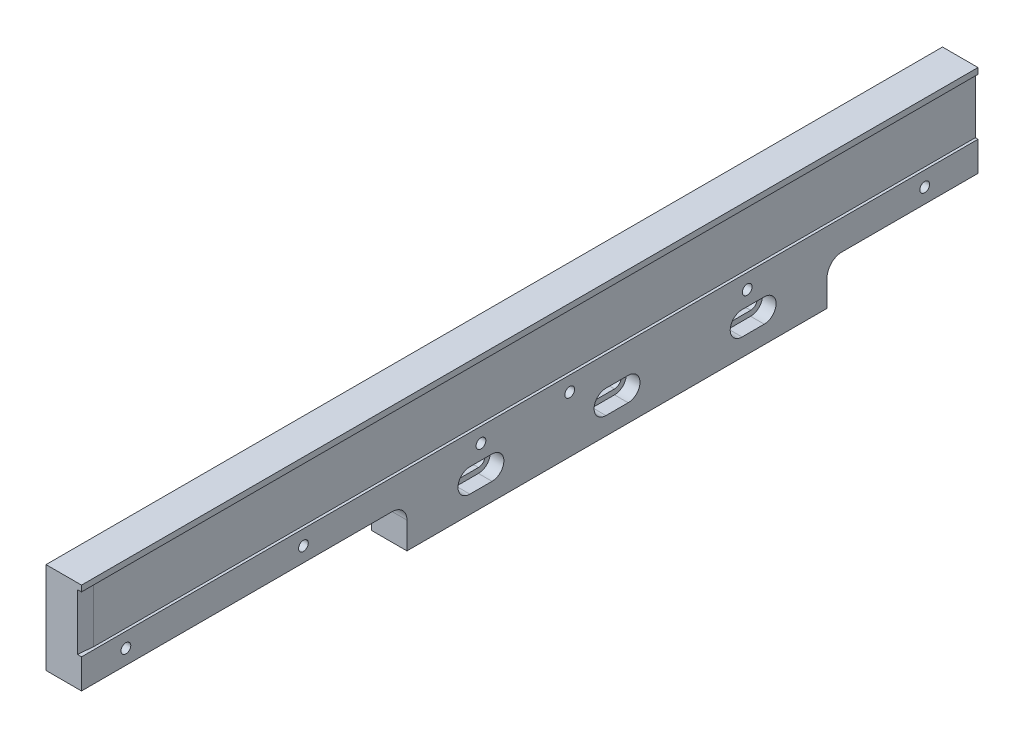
ISO-10303-21;
HEADER;
FILE_DESCRIPTION(('STEP AP214'),'2;1');
FILE_NAME('part.step','',(''),(''),'','','');
FILE_SCHEMA(('AUTOMOTIVE_DESIGN { 1 0 10303 214 1 1 1 1 }'));
ENDSEC;
DATA;
#1=APPLICATION_CONTEXT('core data for automotive mechanical design processes');
#2=APPLICATION_PROTOCOL_DEFINITION('international standard','automotive_design',2000,#1);
#3=PRODUCT_CONTEXT('',#1,'mechanical');
#4=PRODUCT('Part','Part','',(#3));
#5=PRODUCT_RELATED_PRODUCT_CATEGORY('part','',(#4));
#6=PRODUCT_DEFINITION_FORMATION('','',#4);
#7=PRODUCT_DEFINITION_CONTEXT('part definition',#1,'design');
#8=PRODUCT_DEFINITION('design','',#6,#7);
#9=PRODUCT_DEFINITION_SHAPE('','',#8);
#10=(LENGTH_UNIT() NAMED_UNIT(*) SI_UNIT(.MILLI.,.METRE.));
#11=(NAMED_UNIT(*) PLANE_ANGLE_UNIT() SI_UNIT($,.RADIAN.));
#12=(NAMED_UNIT(*) SI_UNIT($,.STERADIAN.) SOLID_ANGLE_UNIT());
#13=UNCERTAINTY_MEASURE_WITH_UNIT(LENGTH_MEASURE(1.E-05),#10,'distance_accuracy_value','');
#14=(GEOMETRIC_REPRESENTATION_CONTEXT(3) GLOBAL_UNCERTAINTY_ASSIGNED_CONTEXT((#13)) GLOBAL_UNIT_ASSIGNED_CONTEXT((#10,
#11,#12)) REPRESENTATION_CONTEXT('',''));
#15=CARTESIAN_POINT('',(0.,0.,0.));
#16=DIRECTION('',(0.,0.,1.));
#17=DIRECTION('',(1.,0.,0.));
#18=AXIS2_PLACEMENT_3D('',#15,#16,#17);
#19=CARTESIAN_POINT('',(112.,-13.7078666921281,260.));
#20=DIRECTION('',(-1.,0.,0.));
#21=DIRECTION('',(0.,0.,1.));
#22=AXIS2_PLACEMENT_3D('',#19,#20,#21);
#23=PLANE('',#22);
#24=CARTESIAN_POINT('',(112.,-8.70786669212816,307.));
#25=DIRECTION('',(1.,0.,0.));
#26=DIRECTION('',(0.,0.,-1.));
#27=AXIS2_PLACEMENT_3D('',#24,#25,#26);
#28=CIRCLE('',#27,1.65);
#29=CARTESIAN_POINT('',(112.,-8.70786669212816,305.35));
#30=VERTEX_POINT('',#29);
#31=EDGE_CURVE('E595',#30,#30,#28,.T.);
#32=ORIENTED_EDGE('',*,*,#31,.F.);
#33=EDGE_LOOP('',(#32));
#34=FACE_BOUND('',#33,.T.);
#35=CARTESIAN_POINT('',(112.,-8.70786669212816,247.));
#36=DIRECTION('',(1.,0.,0.));
#37=DIRECTION('',(0.,0.,-1.));
#38=AXIS2_PLACEMENT_3D('',#35,#36,#37);
#39=CIRCLE('',#38,1.65);
#40=CARTESIAN_POINT('',(112.,-8.70786669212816,245.35));
#41=VERTEX_POINT('',#40);
#42=EDGE_CURVE('E605',#41,#41,#39,.T.);
#43=ORIENTED_EDGE('',*,*,#42,.F.);
#44=EDGE_LOOP('',(#43));
#45=FACE_BOUND('',#44,.T.);
#46=CARTESIAN_POINT('',(112.,-8.70786669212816,187.));
#47=DIRECTION('',(1.,0.,0.));
#48=DIRECTION('',(0.,0.,-1.));
#49=AXIS2_PLACEMENT_3D('',#46,#47,#48);
#50=CIRCLE('',#49,1.65);
#51=CARTESIAN_POINT('',(112.,-8.70786669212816,185.35));
#52=VERTEX_POINT('',#51);
#53=EDGE_CURVE('E611',#52,#52,#50,.T.);
#54=ORIENTED_EDGE('',*,*,#53,.F.);
#55=EDGE_LOOP('',(#54));
#56=FACE_BOUND('',#55,.T.);
#57=CARTESIAN_POINT('',(112.,-8.70786669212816,157.));
#58=DIRECTION('',(1.,0.,0.));
#59=DIRECTION('',(0.,0.,-1.));
#60=AXIS2_PLACEMENT_3D('',#57,#58,#59);
#61=CIRCLE('',#60,1.65);
#62=CARTESIAN_POINT('',(112.,-8.70786669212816,155.35));
#63=VERTEX_POINT('',#62);
#64=EDGE_CURVE('E617',#63,#63,#61,.T.);
#65=ORIENTED_EDGE('',*,*,#64,.F.);
#66=EDGE_LOOP('',(#65));
#67=FACE_BOUND('',#66,.T.);
#68=CARTESIAN_POINT('',(112.,-8.70786669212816,97.));
#69=DIRECTION('',(1.,0.,0.));
#70=DIRECTION('',(0.,0.,-1.));
#71=AXIS2_PLACEMENT_3D('',#68,#69,#70);
#72=CIRCLE('',#71,1.65);
#73=CARTESIAN_POINT('',(112.,-8.70786669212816,95.35));
#74=VERTEX_POINT('',#73);
#75=EDGE_CURVE('E623',#74,#74,#72,.T.);
#76=ORIENTED_EDGE('',*,*,#75,.F.);
#77=EDGE_LOOP('',(#76));
#78=FACE_BOUND('',#77,.T.);
#79=CARTESIAN_POINT('',(112.,-17.7078666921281,183.25));
#80=DIRECTION('',(1.,0.,0.));
#81=DIRECTION('',(0.,0.,-1.));
#82=AXIS2_PLACEMENT_3D('',#79,#80,#81);
#83=CIRCLE('',#82,4.);
#84=CARTESIAN_POINT('',(112.,-21.7078666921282,183.25));
#85=VERTEX_POINT('',#84);
#86=CARTESIAN_POINT('',(112.,-13.7078666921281,183.25));
#87=VERTEX_POINT('',#86);
#88=EDGE_CURVE('E391',#85,#87,#83,.T.);
#89=ORIENTED_EDGE('',*,*,#88,.F.);
#90=DIRECTION('',(0.,0.,1.));
#91=VECTOR('',#90,1.);
#92=CARTESIAN_POINT('',(112.,-21.7078666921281,183.25));
#93=LINE('',#92,#91);
#94=CARTESIAN_POINT('',(112.,-21.7078666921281,190.75));
#95=VERTEX_POINT('',#94);
#96=EDGE_CURVE('E380',#85,#95,#93,.T.);
#97=ORIENTED_EDGE('',*,*,#96,.T.);
#98=CARTESIAN_POINT('',(112.,-17.7078666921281,190.75));
#99=DIRECTION('',(1.,0.,0.));
#100=DIRECTION('',(0.,0.,-1.));
#101=AXIS2_PLACEMENT_3D('',#98,#99,#100);
#102=CIRCLE('',#101,4.);
#103=CARTESIAN_POINT('',(112.,-13.7078666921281,190.75));
#104=VERTEX_POINT('',#103);
#105=EDGE_CURVE('E411',#104,#95,#102,.T.);
#106=ORIENTED_EDGE('',*,*,#105,.F.);
#107=DIRECTION('',(0.,0.,1.));
#108=VECTOR('',#107,1.);
#109=CARTESIAN_POINT('',(112.,-13.7078666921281,183.25));
#110=LINE('',#109,#108);
#111=EDGE_CURVE('E365',#87,#104,#110,.T.);
#112=ORIENTED_EDGE('',*,*,#111,.F.);
#113=EDGE_LOOP('',(#89,#97,#106,#112));
#114=FACE_BOUND('',#113,.T.);
#115=CARTESIAN_POINT('',(112.,-17.7078666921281,137.25));
#116=DIRECTION('',(1.,0.,0.));
#117=DIRECTION('',(0.,0.,-1.));
#118=AXIS2_PLACEMENT_3D('',#115,#116,#117);
#119=CIRCLE('',#118,4.);
#120=CARTESIAN_POINT('',(112.,-21.7078666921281,137.25));
#121=VERTEX_POINT('',#120);
#122=CARTESIAN_POINT('',(112.,-13.7078666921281,137.25));
#123=VERTEX_POINT('',#122);
#124=EDGE_CURVE('E451',#121,#123,#119,.T.);
#125=ORIENTED_EDGE('',*,*,#124,.F.);
#126=DIRECTION('',(0.,0.,1.));
#127=VECTOR('',#126,1.);
#128=CARTESIAN_POINT('',(112.,-21.7078666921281,137.25));
#129=LINE('',#128,#127);
#130=CARTESIAN_POINT('',(112.,-21.7078666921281,144.75));
#131=VERTEX_POINT('',#130);
#132=EDGE_CURVE('E440',#121,#131,#129,.T.);
#133=ORIENTED_EDGE('',*,*,#132,.T.);
#134=CARTESIAN_POINT('',(112.,-17.7078666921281,144.75));
#135=DIRECTION('',(1.,0.,0.));
#136=DIRECTION('',(0.,0.,-1.));
#137=AXIS2_PLACEMENT_3D('',#134,#135,#136);
#138=CIRCLE('',#137,4.);
#139=CARTESIAN_POINT('',(112.,-13.7078666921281,144.75));
#140=VERTEX_POINT('',#139);
#141=EDGE_CURVE('E471',#140,#131,#138,.T.);
#142=ORIENTED_EDGE('',*,*,#141,.F.);
#143=DIRECTION('',(0.,0.,1.));
#144=VECTOR('',#143,1.);
#145=CARTESIAN_POINT('',(112.,-13.7078666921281,137.25));
#146=LINE('',#145,#144);
#147=EDGE_CURVE('E425',#123,#140,#146,.T.);
#148=ORIENTED_EDGE('',*,*,#147,.F.);
#149=EDGE_LOOP('',(#125,#133,#142,#148));
#150=FACE_BOUND('',#149,.T.);
#151=DIRECTION('',(0.,0.,-1.));
#152=VECTOR('',#151,1.);
#153=CARTESIAN_POINT('',(112.,-13.7078666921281,260.));
#154=LINE('',#153,#152);
#155=CARTESIAN_POINT('',(112.,-13.7078666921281,65.));
#156=VERTEX_POINT('',#155);
#157=CARTESIAN_POINT('',(112.,-13.7078666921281,19.));
#158=VERTEX_POINT('',#157);
#159=EDGE_CURVE('E299',#156,#158,#154,.T.);
#160=ORIENTED_EDGE('',*,*,#159,.T.);
#161=DIRECTION('',(0.,-1.,0.));
#162=VECTOR('',#161,1.);
#163=CARTESIAN_POINT('',(112.,-13.7078666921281,19.));
#164=LINE('',#163,#162);
#165=CARTESIAN_POINT('',(112.,-3.70786669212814,19.));
#166=VERTEX_POINT('',#165);
#167=EDGE_CURVE('E270',#166,#158,#164,.T.);
#168=ORIENTED_EDGE('',*,*,#167,.F.);
#169=DIRECTION('',(0.,0.,-1.));
#170=VECTOR('',#169,1.);
#171=CARTESIAN_POINT('',(112.,-3.70786669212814,260.));
#172=LINE('',#171,#170);
#173=CARTESIAN_POINT('',(112.,-3.70786669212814,322.));
#174=VERTEX_POINT('',#173);
#175=EDGE_CURVE('E348',#174,#166,#172,.T.);
#176=ORIENTED_EDGE('',*,*,#175,.F.);
#177=DIRECTION('',(0.,1.,0.));
#178=VECTOR('',#177,1.);
#179=CARTESIAN_POINT('',(112.,-13.7078666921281,322.));
#180=LINE('',#179,#178);
#181=CARTESIAN_POINT('',(112.,-13.7078666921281,322.));
#182=VERTEX_POINT('',#181);
#183=EDGE_CURVE('E346',#182,#174,#180,.T.);
#184=ORIENTED_EDGE('',*,*,#183,.F.);
#185=CARTESIAN_POINT('',(112.,-13.7078666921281,217.));
#186=VERTEX_POINT('',#185);
#187=EDGE_CURVE('E293',#182,#186,#154,.T.);
#188=ORIENTED_EDGE('',*,*,#187,.T.);
#189=CARTESIAN_POINT('',(112.,-18.7078666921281,217.));
#190=DIRECTION('',(-1.,0.,0.));
#191=DIRECTION('',(0.,0.,1.));
#192=AXIS2_PLACEMENT_3D('',#189,#190,#191);
#193=CIRCLE('',#192,5.);
#194=CARTESIAN_POINT('',(112.,-18.7078666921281,212.));
#195=VERTEX_POINT('',#194);
#196=EDGE_CURVE('E344',#186,#195,#193,.T.);
#197=ORIENTED_EDGE('',*,*,#196,.T.);
#198=DIRECTION('',(0.,-1.,0.));
#199=VECTOR('',#198,1.);
#200=CARTESIAN_POINT('',(112.,-13.7078666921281,212.));
#201=LINE('',#200,#199);
#202=CARTESIAN_POINT('',(112.,-27.7078666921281,212.));
#203=VERTEX_POINT('',#202);
#204=EDGE_CURVE('E318',#195,#203,#201,.T.);
#205=ORIENTED_EDGE('',*,*,#204,.T.);
#206=DIRECTION('',(0.,0.,-1.));
#207=VECTOR('',#206,1.);
#208=CARTESIAN_POINT('',(112.,-27.7078666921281,212.));
#209=LINE('',#208,#207);
#210=CARTESIAN_POINT('',(112.,-27.7078666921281,70.));
#211=VERTEX_POINT('',#210);
#212=EDGE_CURVE('E321',#203,#211,#209,.T.);
#213=ORIENTED_EDGE('',*,*,#212,.T.);
#214=DIRECTION('',(0.,1.,0.));
#215=VECTOR('',#214,1.);
#216=CARTESIAN_POINT('',(112.,-13.7078666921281,70.));
#217=LINE('',#216,#215);
#218=CARTESIAN_POINT('',(112.,-18.7078666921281,70.));
#219=VERTEX_POINT('',#218);
#220=EDGE_CURVE('E326',#211,#219,#217,.T.);
#221=ORIENTED_EDGE('',*,*,#220,.T.);
#222=CARTESIAN_POINT('',(112.,-18.7078666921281,65.));
#223=DIRECTION('',(-1.,0.,0.));
#224=DIRECTION('',(0.,0.,1.));
#225=AXIS2_PLACEMENT_3D('',#222,#223,#224);
#226=CIRCLE('',#225,5.);
#227=EDGE_CURVE('E569',#219,#156,#226,.T.);
#228=ORIENTED_EDGE('',*,*,#227,.T.);
#229=EDGE_LOOP('',(#160,#168,#176,#184,#188,#197,#205,#213,#221,#228));
#230=FACE_BOUND('',#229,.T.);
#231=CARTESIAN_POINT('',(112.,-17.7078666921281,98.75));
#232=DIRECTION('',(1.,0.,0.));
#233=DIRECTION('',(0.,0.,-1.));
#234=AXIS2_PLACEMENT_3D('',#231,#232,#233);
#235=CIRCLE('',#234,4.);
#236=CARTESIAN_POINT('',(112.,-13.7078666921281,98.75));
#237=VERTEX_POINT('',#236);
#238=CARTESIAN_POINT('',(112.,-21.7078666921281,98.75));
#239=VERTEX_POINT('',#238);
#240=EDGE_CURVE('E532',#237,#239,#235,.T.);
#241=ORIENTED_EDGE('',*,*,#240,.F.);
#242=DIRECTION('',(0.,0.,1.));
#243=VECTOR('',#242,1.);
#244=CARTESIAN_POINT('',(112.,-13.7078666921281,91.25));
#245=LINE('',#244,#243);
#246=CARTESIAN_POINT('',(112.,-13.7078666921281,91.25));
#247=VERTEX_POINT('',#246);
#248=EDGE_CURVE('E485',#247,#237,#245,.T.);
#249=ORIENTED_EDGE('',*,*,#248,.F.);
#250=CARTESIAN_POINT('',(112.,-17.7078666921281,91.25));
#251=DIRECTION('',(1.,0.,0.));
#252=DIRECTION('',(0.,0.,-1.));
#253=AXIS2_PLACEMENT_3D('',#250,#251,#252);
#254=CIRCLE('',#253,4.);
#255=CARTESIAN_POINT('',(112.,-21.7078666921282,91.25));
#256=VERTEX_POINT('',#255);
#257=EDGE_CURVE('E512',#256,#247,#254,.T.);
#258=ORIENTED_EDGE('',*,*,#257,.F.);
#259=DIRECTION('',(0.,0.,1.));
#260=VECTOR('',#259,1.);
#261=CARTESIAN_POINT('',(112.,-21.7078666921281,91.25));
#262=LINE('',#261,#260);
#263=EDGE_CURVE('E500',#256,#239,#262,.T.);
#264=ORIENTED_EDGE('',*,*,#263,.T.);
#265=EDGE_LOOP('',(#241,#249,#258,#264));
#266=FACE_BOUND('',#265,.T.);
#267=CARTESIAN_POINT('',(112.,-8.70786669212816,37.));
#268=DIRECTION('',(1.,0.,0.));
#269=DIRECTION('',(0.,0.,-1.));
#270=AXIS2_PLACEMENT_3D('',#267,#268,#269);
#271=CIRCLE('',#270,1.65);
#272=CARTESIAN_POINT('',(112.,-8.70786669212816,35.35));
#273=VERTEX_POINT('',#272);
#274=EDGE_CURVE('E629',#273,#273,#271,.T.);
#275=ORIENTED_EDGE('',*,*,#274,.F.);
#276=EDGE_LOOP('',(#275));
#277=FACE_BOUND('',#276,.T.);
#278=ADVANCED_FACE('F16',(#34,#45,#56,#67,#78,#114,#150,#230,#266,#277),#23,.F.);
#279=CARTESIAN_POINT('',(100.,-13.7078666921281,260.));
#280=DIRECTION('',(1.,0.,0.));
#281=DIRECTION('',(0.,0.,-1.));
#282=AXIS2_PLACEMENT_3D('',#279,#280,#281);
#283=PLANE('',#282);
#284=CARTESIAN_POINT('',(100.,-8.70786669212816,307.));
#285=DIRECTION('',(1.,0.,0.));
#286=DIRECTION('',(0.,0.,-1.));
#287=AXIS2_PLACEMENT_3D('',#284,#285,#286);
#288=CIRCLE('',#287,1.65);
#289=CARTESIAN_POINT('',(100.,-8.70786669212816,305.35));
#290=VERTEX_POINT('',#289);
#291=EDGE_CURVE('E598',#290,#290,#288,.T.);
#292=ORIENTED_EDGE('',*,*,#291,.T.);
#293=EDGE_LOOP('',(#292));
#294=FACE_BOUND('',#293,.T.);
#295=CARTESIAN_POINT('',(100.,-8.70786669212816,247.));
#296=DIRECTION('',(1.,0.,0.));
#297=DIRECTION('',(0.,0.,-1.));
#298=AXIS2_PLACEMENT_3D('',#295,#296,#297);
#299=CIRCLE('',#298,1.65);
#300=CARTESIAN_POINT('',(100.,-8.70786669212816,245.35));
#301=VERTEX_POINT('',#300);
#302=EDGE_CURVE('E608',#301,#301,#299,.T.);
#303=ORIENTED_EDGE('',*,*,#302,.T.);
#304=EDGE_LOOP('',(#303));
#305=FACE_BOUND('',#304,.T.);
#306=CARTESIAN_POINT('',(100.,-8.70786669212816,187.));
#307=DIRECTION('',(1.,0.,0.));
#308=DIRECTION('',(0.,0.,-1.));
#309=AXIS2_PLACEMENT_3D('',#306,#307,#308);
#310=CIRCLE('',#309,1.65);
#311=CARTESIAN_POINT('',(100.,-8.70786669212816,185.35));
#312=VERTEX_POINT('',#311);
#313=EDGE_CURVE('E614',#312,#312,#310,.T.);
#314=ORIENTED_EDGE('',*,*,#313,.T.);
#315=EDGE_LOOP('',(#314));
#316=FACE_BOUND('',#315,.T.);
#317=CARTESIAN_POINT('',(100.,-8.70786669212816,157.));
#318=DIRECTION('',(1.,0.,0.));
#319=DIRECTION('',(0.,0.,-1.));
#320=AXIS2_PLACEMENT_3D('',#317,#318,#319);
#321=CIRCLE('',#320,1.65);
#322=CARTESIAN_POINT('',(100.,-8.70786669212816,155.35));
#323=VERTEX_POINT('',#322);
#324=EDGE_CURVE('E620',#323,#323,#321,.T.);
#325=ORIENTED_EDGE('',*,*,#324,.T.);
#326=EDGE_LOOP('',(#325));
#327=FACE_BOUND('',#326,.T.);
#328=CARTESIAN_POINT('',(100.,-8.70786669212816,97.));
#329=DIRECTION('',(1.,0.,0.));
#330=DIRECTION('',(0.,0.,-1.));
#331=AXIS2_PLACEMENT_3D('',#328,#329,#330);
#332=CIRCLE('',#331,1.65);
#333=CARTESIAN_POINT('',(100.,-8.70786669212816,95.35));
#334=VERTEX_POINT('',#333);
#335=EDGE_CURVE('E626',#334,#334,#332,.T.);
#336=ORIENTED_EDGE('',*,*,#335,.T.);
#337=EDGE_LOOP('',(#336));
#338=FACE_BOUND('',#337,.T.);
#339=CARTESIAN_POINT('',(100.,-8.70786669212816,37.));
#340=DIRECTION('',(1.,0.,0.));
#341=DIRECTION('',(0.,0.,-1.));
#342=AXIS2_PLACEMENT_3D('',#339,#340,#341);
#343=CIRCLE('',#342,1.65);
#344=CARTESIAN_POINT('',(100.,-8.70786669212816,35.35));
#345=VERTEX_POINT('',#344);
#346=EDGE_CURVE('E632',#345,#345,#343,.T.);
#347=ORIENTED_EDGE('',*,*,#346,.T.);
#348=EDGE_LOOP('',(#347));
#349=FACE_BOUND('',#348,.T.);
#350=DIRECTION('',(0.,0.,-1.));
#351=VECTOR('',#350,1.);
#352=CARTESIAN_POINT('',(100.,17.2921333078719,260.));
#353=LINE('',#352,#351);
#354=CARTESIAN_POINT('',(100.,17.2921333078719,322.));
#355=VERTEX_POINT('',#354);
#356=CARTESIAN_POINT('',(100.,17.2921333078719,19.));
#357=VERTEX_POINT('',#356);
#358=EDGE_CURVE('E286',#355,#357,#353,.T.);
#359=ORIENTED_EDGE('',*,*,#358,.T.);
#360=DIRECTION('',(0.,-1.,0.));
#361=VECTOR('',#360,1.);
#362=CARTESIAN_POINT('',(100.,-13.7078666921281,19.));
#363=LINE('',#362,#361);
#364=CARTESIAN_POINT('',(100.,-13.7078666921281,19.));
#365=VERTEX_POINT('',#364);
#366=EDGE_CURVE('E31',#357,#365,#363,.T.);
#367=ORIENTED_EDGE('',*,*,#366,.T.);
#368=DIRECTION('',(0.,0.,-1.));
#369=VECTOR('',#368,1.);
#370=CARTESIAN_POINT('',(100.,-13.7078666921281,260.));
#371=LINE('',#370,#369);
#372=CARTESIAN_POINT('',(100.,-13.7078666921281,65.));
#373=VERTEX_POINT('',#372);
#374=EDGE_CURVE('E283',#373,#365,#371,.T.);
#375=ORIENTED_EDGE('',*,*,#374,.F.);
#376=CARTESIAN_POINT('',(100.,-18.7078666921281,65.));
#377=DIRECTION('',(1.,0.,0.));
#378=DIRECTION('',(0.,0.,-1.));
#379=AXIS2_PLACEMENT_3D('',#376,#377,#378);
#380=CIRCLE('',#379,5.);
#381=CARTESIAN_POINT('',(100.,-18.7078666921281,70.));
#382=VERTEX_POINT('',#381);
#383=EDGE_CURVE('E573',#373,#382,#380,.T.);
#384=ORIENTED_EDGE('',*,*,#383,.T.);
#385=DIRECTION('',(0.,1.,0.));
#386=VECTOR('',#385,1.);
#387=CARTESIAN_POINT('',(100.,-13.7078666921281,70.));
#388=LINE('',#387,#386);
#389=CARTESIAN_POINT('',(100.,-27.7078666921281,70.));
#390=VERTEX_POINT('',#389);
#391=EDGE_CURVE('E547',#390,#382,#388,.T.);
#392=ORIENTED_EDGE('',*,*,#391,.F.);
#393=DIRECTION('',(0.,0.,-1.));
#394=VECTOR('',#393,1.);
#395=CARTESIAN_POINT('',(100.,-27.7078666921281,212.));
#396=LINE('',#395,#394);
#397=CARTESIAN_POINT('',(100.,-27.7078666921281,212.));
#398=VERTEX_POINT('',#397);
#399=EDGE_CURVE('E325',#398,#390,#396,.T.);
#400=ORIENTED_EDGE('',*,*,#399,.F.);
#401=DIRECTION('',(0.,-1.,0.));
#402=VECTOR('',#401,1.);
#403=CARTESIAN_POINT('',(100.,-13.7078666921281,212.));
#404=LINE('',#403,#402);
#405=CARTESIAN_POINT('',(100.,-18.7078666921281,212.));
#406=VERTEX_POINT('',#405);
#407=EDGE_CURVE('E324',#406,#398,#404,.T.);
#408=ORIENTED_EDGE('',*,*,#407,.F.);
#409=CARTESIAN_POINT('',(100.,-18.7078666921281,217.));
#410=DIRECTION('',(1.,0.,0.));
#411=DIRECTION('',(0.,0.,-1.));
#412=AXIS2_PLACEMENT_3D('',#409,#410,#411);
#413=CIRCLE('',#412,5.);
#414=CARTESIAN_POINT('',(100.,-13.7078666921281,217.));
#415=VERTEX_POINT('',#414);
#416=EDGE_CURVE('E574',#406,#415,#413,.T.);
#417=ORIENTED_EDGE('',*,*,#416,.T.);
#418=CARTESIAN_POINT('',(100.,-13.7078666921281,322.));
#419=VERTEX_POINT('',#418);
#420=EDGE_CURVE('E292',#419,#415,#371,.T.);
#421=ORIENTED_EDGE('',*,*,#420,.F.);
#422=DIRECTION('',(0.,-1.,0.));
#423=VECTOR('',#422,1.);
#424=CARTESIAN_POINT('',(100.,17.2921333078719,322.));
#425=LINE('',#424,#423);
#426=EDGE_CURVE('E356',#355,#419,#425,.T.);
#427=ORIENTED_EDGE('',*,*,#426,.F.);
#428=EDGE_LOOP('',(#359,#367,#375,#384,#392,#400,#408,#417,#421,#427));
#429=FACE_BOUND('',#428,.T.);
#430=DIRECTION('',(0.,0.,1.));
#431=VECTOR('',#430,1.);
#432=CARTESIAN_POINT('',(100.,-15.4578666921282,91.25));
#433=LINE('',#432,#431);
#434=CARTESIAN_POINT('',(100.,-15.4578666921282,91.25));
#435=VERTEX_POINT('',#434);
#436=CARTESIAN_POINT('',(100.,-15.4578666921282,98.75));
#437=VERTEX_POINT('',#436);
#438=EDGE_CURVE('E491',#435,#437,#433,.T.);
#439=ORIENTED_EDGE('',*,*,#438,.T.);
#440=CARTESIAN_POINT('',(100.,-17.7078666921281,98.75));
#441=DIRECTION('',(1.,0.,0.));
#442=DIRECTION('',(0.,0.,-1.));
#443=AXIS2_PLACEMENT_3D('',#440,#441,#442);
#444=CIRCLE('',#443,2.25);
#445=CARTESIAN_POINT('',(100.,-19.9578666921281,98.75));
#446=VERTEX_POINT('',#445);
#447=EDGE_CURVE('E541',#437,#446,#444,.T.);
#448=ORIENTED_EDGE('',*,*,#447,.T.);
#449=DIRECTION('',(0.,0.,1.));
#450=VECTOR('',#449,1.);
#451=CARTESIAN_POINT('',(100.,-19.9578666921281,91.25));
#452=LINE('',#451,#450);
#453=CARTESIAN_POINT('',(100.,-19.9578666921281,91.25));
#454=VERTEX_POINT('',#453);
#455=EDGE_CURVE('E494',#454,#446,#452,.T.);
#456=ORIENTED_EDGE('',*,*,#455,.F.);
#457=CARTESIAN_POINT('',(100.,-17.7078666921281,91.25));
#458=DIRECTION('',(1.,0.,0.));
#459=DIRECTION('',(0.,0.,-1.));
#460=AXIS2_PLACEMENT_3D('',#457,#458,#459);
#461=CIRCLE('',#460,2.25);
#462=EDGE_CURVE('E518',#454,#435,#461,.T.);
#463=ORIENTED_EDGE('',*,*,#462,.T.);
#464=EDGE_LOOP('',(#439,#448,#456,#463));
#465=FACE_BOUND('',#464,.T.);
#466=CARTESIAN_POINT('',(100.,-17.7078666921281,144.75));
#467=DIRECTION('',(1.,0.,0.));
#468=DIRECTION('',(0.,0.,-1.));
#469=AXIS2_PLACEMENT_3D('',#466,#467,#468);
#470=CIRCLE('',#469,2.25);
#471=CARTESIAN_POINT('',(100.,-15.4578666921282,144.75));
#472=VERTEX_POINT('',#471);
#473=CARTESIAN_POINT('',(100.,-19.9578666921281,144.75));
#474=VERTEX_POINT('',#473);
#475=EDGE_CURVE('E480',#472,#474,#470,.T.);
#476=ORIENTED_EDGE('',*,*,#475,.T.);
#477=DIRECTION('',(0.,0.,1.));
#478=VECTOR('',#477,1.);
#479=CARTESIAN_POINT('',(100.,-19.9578666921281,137.25));
#480=LINE('',#479,#478);
#481=CARTESIAN_POINT('',(100.,-19.9578666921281,137.25));
#482=VERTEX_POINT('',#481);
#483=EDGE_CURVE('E434',#482,#474,#480,.T.);
#484=ORIENTED_EDGE('',*,*,#483,.F.);
#485=CARTESIAN_POINT('',(100.,-17.7078666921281,137.25));
#486=DIRECTION('',(1.,0.,0.));
#487=DIRECTION('',(0.,0.,-1.));
#488=AXIS2_PLACEMENT_3D('',#485,#486,#487);
#489=CIRCLE('',#488,2.25);
#490=CARTESIAN_POINT('',(100.,-15.4578666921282,137.25));
#491=VERTEX_POINT('',#490);
#492=EDGE_CURVE('E458',#482,#491,#489,.T.);
#493=ORIENTED_EDGE('',*,*,#492,.T.);
#494=DIRECTION('',(0.,0.,1.));
#495=VECTOR('',#494,1.);
#496=CARTESIAN_POINT('',(100.,-15.4578666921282,137.25));
#497=LINE('',#496,#495);
#498=EDGE_CURVE('E431',#491,#472,#497,.T.);
#499=ORIENTED_EDGE('',*,*,#498,.T.);
#500=EDGE_LOOP('',(#476,#484,#493,#499));
#501=FACE_BOUND('',#500,.T.);
#502=DIRECTION('',(0.,0.,1.));
#503=VECTOR('',#502,1.);
#504=CARTESIAN_POINT('',(100.,-19.9578666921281,183.25));
#505=LINE('',#504,#503);
#506=CARTESIAN_POINT('',(100.,-19.9578666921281,183.25));
#507=VERTEX_POINT('',#506);
#508=CARTESIAN_POINT('',(100.,-19.9578666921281,190.75));
#509=VERTEX_POINT('',#508);
#510=EDGE_CURVE('E374',#507,#509,#505,.T.);
#511=ORIENTED_EDGE('',*,*,#510,.F.);
#512=CARTESIAN_POINT('',(100.,-17.7078666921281,183.25));
#513=DIRECTION('',(1.,0.,0.));
#514=DIRECTION('',(0.,0.,-1.));
#515=AXIS2_PLACEMENT_3D('',#512,#513,#514);
#516=CIRCLE('',#515,2.25);
#517=CARTESIAN_POINT('',(100.,-15.4578666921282,183.25));
#518=VERTEX_POINT('',#517);
#519=EDGE_CURVE('E398',#507,#518,#516,.T.);
#520=ORIENTED_EDGE('',*,*,#519,.T.);
#521=DIRECTION('',(0.,0.,1.));
#522=VECTOR('',#521,1.);
#523=CARTESIAN_POINT('',(100.,-15.4578666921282,183.25));
#524=LINE('',#523,#522);
#525=CARTESIAN_POINT('',(100.,-15.4578666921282,190.75));
#526=VERTEX_POINT('',#525);
#527=EDGE_CURVE('E371',#518,#526,#524,.T.);
#528=ORIENTED_EDGE('',*,*,#527,.T.);
#529=CARTESIAN_POINT('',(100.,-17.7078666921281,190.75));
#530=DIRECTION('',(1.,0.,0.));
#531=DIRECTION('',(0.,0.,-1.));
#532=AXIS2_PLACEMENT_3D('',#529,#530,#531);
#533=CIRCLE('',#532,2.25);
#534=EDGE_CURVE('E420',#526,#509,#533,.T.);
#535=ORIENTED_EDGE('',*,*,#534,.T.);
#536=EDGE_LOOP('',(#511,#520,#528,#535));
#537=FACE_BOUND('',#536,.T.);
#538=ADVANCED_FACE('F281',(#294,#305,#316,#327,#338,#349,#429,#465,#501,#537),#283,.F.);
#539=CARTESIAN_POINT('',(100.,-13.7078666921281,260.));
#540=DIRECTION('',(0.,1.,0.));
#541=DIRECTION('',(-1.,0.,0.));
#542=AXIS2_PLACEMENT_3D('',#539,#540,#541);
#543=PLANE('',#542);
#544=ORIENTED_EDGE('',*,*,#374,.T.);
#545=DIRECTION('',(1.,0.,0.));
#546=VECTOR('',#545,1.);
#547=CARTESIAN_POINT('',(100.,-13.7078666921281,19.));
#548=LINE('',#547,#546);
#549=EDGE_CURVE('E267',#365,#158,#548,.T.);
#550=ORIENTED_EDGE('',*,*,#549,.T.);
#551=ORIENTED_EDGE('',*,*,#159,.F.);
#552=DIRECTION('',(1.,0.,0.));
#553=VECTOR('',#552,1.);
#554=CARTESIAN_POINT('',(100.,-13.7078666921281,65.));
#555=LINE('',#554,#553);
#556=EDGE_CURVE('E291',#156,#373,#555,.F.);
#557=ORIENTED_EDGE('',*,*,#556,.T.);
#558=EDGE_LOOP('',(#544,#550,#551,#557));
#559=FACE_BOUND('',#558,.T.);
#560=ADVANCED_FACE('F289',(#559),#543,.F.);
#561=ORIENTED_EDGE('',*,*,#420,.T.);
#562=DIRECTION('',(1.,0.,0.));
#563=VECTOR('',#562,1.);
#564=CARTESIAN_POINT('',(100.,-13.7078666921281,217.));
#565=LINE('',#564,#563);
#566=EDGE_CURVE('E296',#415,#186,#565,.T.);
#567=ORIENTED_EDGE('',*,*,#566,.T.);
#568=ORIENTED_EDGE('',*,*,#187,.F.);
#569=DIRECTION('',(1.,0.,0.));
#570=VECTOR('',#569,1.);
#571=CARTESIAN_POINT('',(100.,-13.7078666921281,322.));
#572=LINE('',#571,#570);
#573=EDGE_CURVE('E352',#419,#182,#572,.T.);
#574=ORIENTED_EDGE('',*,*,#573,.F.);
#575=EDGE_LOOP('',(#561,#567,#568,#574));
#576=FACE_BOUND('',#575,.T.);
#577=ADVANCED_FACE('F336',(#576),#543,.F.);
#578=CARTESIAN_POINT('',(112.,-3.70786669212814,260.));
#579=DIRECTION('',(0.,-1.,0.));
#580=DIRECTION('',(0.,0.,-1.));
#581=AXIS2_PLACEMENT_3D('',#578,#579,#580);
#582=PLANE('',#581);
#583=ORIENTED_EDGE('',*,*,#175,.T.);
#584=DIRECTION('',(-1.,0.,0.));
#585=VECTOR('',#584,1.);
#586=CARTESIAN_POINT('',(112.,-3.70786669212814,19.));
#587=LINE('',#586,#585);
#588=CARTESIAN_POINT('',(111.1,-3.70786669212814,19.));
#589=VERTEX_POINT('',#588);
#590=EDGE_CURVE('E594',#166,#589,#587,.T.);
#591=ORIENTED_EDGE('',*,*,#590,.T.);
#592=DIRECTION('',(0.,0.,-1.));
#593=VECTOR('',#592,1.);
#594=CARTESIAN_POINT('',(111.1,-3.70786669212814,260.));
#595=LINE('',#594,#593);
#596=CARTESIAN_POINT('',(111.1,-3.70786669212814,317.));
#597=VERTEX_POINT('',#596);
#598=EDGE_CURVE('E565',#597,#589,#595,.T.);
#599=ORIENTED_EDGE('',*,*,#598,.F.);
#600=DIRECTION('',(-0.0995037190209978,0.,0.995037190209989));
#601=VECTOR('',#600,1.);
#602=CARTESIAN_POINT('',(116.752475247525,-3.70786669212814,260.475247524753));
#603=LINE('',#602,#601);
#604=CARTESIAN_POINT('',(110.6,-3.70786669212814,322.));
#605=VERTEX_POINT('',#604);
#606=EDGE_CURVE('E11',#597,#605,#603,.T.);
#607=ORIENTED_EDGE('',*,*,#606,.T.);
#608=DIRECTION('',(-1.,0.,0.));
#609=VECTOR('',#608,1.);
#610=CARTESIAN_POINT('',(112.,-3.70786669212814,322.));
#611=LINE('',#610,#609);
#612=EDGE_CURVE('E351',#174,#605,#611,.T.);
#613=ORIENTED_EDGE('',*,*,#612,.F.);
#614=EDGE_LOOP('',(#583,#591,#599,#607,#613));
#615=FACE_BOUND('',#614,.T.);
#616=ADVANCED_FACE('F593',(#615),#582,.F.);
#617=CARTESIAN_POINT('',(111.1,-3.70786669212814,260.));
#618=DIRECTION('',(-1.,0.,0.));
#619=DIRECTION('',(0.,0.,1.));
#620=AXIS2_PLACEMENT_3D('',#617,#618,#619);
#621=PLANE('',#620);
#622=ORIENTED_EDGE('',*,*,#598,.T.);
#623=DIRECTION('',(0.,1.,0.));
#624=VECTOR('',#623,1.);
#625=CARTESIAN_POINT('',(111.1,-3.70786669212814,19.));
#626=LINE('',#625,#624);
#627=CARTESIAN_POINT('',(111.1,15.2921333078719,19.));
#628=VERTEX_POINT('',#627);
#629=EDGE_CURVE('E591',#589,#628,#626,.T.);
#630=ORIENTED_EDGE('',*,*,#629,.T.);
#631=DIRECTION('',(0.,0.,-1.));
#632=VECTOR('',#631,1.);
#633=CARTESIAN_POINT('',(111.1,15.2921333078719,260.));
#634=LINE('',#633,#632);
#635=CARTESIAN_POINT('',(111.1,15.2921333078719,317.));
#636=VERTEX_POINT('',#635);
#637=EDGE_CURVE('E562',#636,#628,#634,.T.);
#638=ORIENTED_EDGE('',*,*,#637,.F.);
#639=DIRECTION('',(0.,-1.,0.));
#640=VECTOR('',#639,1.);
#641=CARTESIAN_POINT('',(111.1,-3.70786669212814,317.));
#642=LINE('',#641,#640);
#643=EDGE_CURVE('E39',#636,#597,#642,.T.);
#644=ORIENTED_EDGE('',*,*,#643,.T.);
#645=EDGE_LOOP('',(#622,#630,#638,#644));
#646=FACE_BOUND('',#645,.T.);
#647=ADVANCED_FACE('F590',(#646),#621,.F.);
#648=CARTESIAN_POINT('',(112.,15.2921333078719,260.));
#649=DIRECTION('',(0.,1.,0.));
#650=DIRECTION('',(0.,0.,1.));
#651=AXIS2_PLACEMENT_3D('',#648,#649,#650);
#652=PLANE('',#651);
#653=ORIENTED_EDGE('',*,*,#637,.T.);
#654=DIRECTION('',(1.,0.,0.));
#655=VECTOR('',#654,1.);
#656=CARTESIAN_POINT('',(112.,15.2921333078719,19.));
#657=LINE('',#656,#655);
#658=CARTESIAN_POINT('',(112.,15.2921333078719,19.));
#659=VERTEX_POINT('',#658);
#660=EDGE_CURVE('E275',#628,#659,#657,.T.);
#661=ORIENTED_EDGE('',*,*,#660,.T.);
#662=DIRECTION('',(0.,0.,-1.));
#663=VECTOR('',#662,1.);
#664=CARTESIAN_POINT('',(112.,15.2921333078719,260.));
#665=LINE('',#664,#663);
#666=CARTESIAN_POINT('',(112.,15.2921333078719,322.));
#667=VERTEX_POINT('',#666);
#668=EDGE_CURVE('E559',#667,#659,#665,.T.);
#669=ORIENTED_EDGE('',*,*,#668,.F.);
#670=DIRECTION('',(1.,0.,0.));
#671=VECTOR('',#670,1.);
#672=CARTESIAN_POINT('',(111.1,15.2921333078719,322.));
#673=LINE('',#672,#671);
#674=CARTESIAN_POINT('',(110.6,15.2921333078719,322.));
#675=VERTEX_POINT('',#674);
#676=EDGE_CURVE('E354',#675,#667,#673,.T.);
#677=ORIENTED_EDGE('',*,*,#676,.F.);
#678=DIRECTION('',(0.0995037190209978,0.,-0.995037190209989));
#679=VECTOR('',#678,1.);
#680=CARTESIAN_POINT('',(116.752475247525,15.2921333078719,260.475247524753));
#681=LINE('',#680,#679);
#682=EDGE_CURVE('E24',#675,#636,#681,.T.);
#683=ORIENTED_EDGE('',*,*,#682,.T.);
#684=EDGE_LOOP('',(#653,#661,#669,#677,#683));
#685=FACE_BOUND('',#684,.T.);
#686=ADVANCED_FACE('F585',(#685),#652,.F.);
#687=CARTESIAN_POINT('',(112.,15.2921333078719,260.));
#688=DIRECTION('',(-1.,0.,0.));
#689=DIRECTION('',(0.,0.,1.));
#690=AXIS2_PLACEMENT_3D('',#687,#688,#689);
#691=PLANE('',#690);
#692=ORIENTED_EDGE('',*,*,#668,.T.);
#693=CARTESIAN_POINT('',(112.,17.2921333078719,19.));
#694=VERTEX_POINT('',#693);
#695=EDGE_CURVE('E287',#694,#659,#164,.T.);
#696=ORIENTED_EDGE('',*,*,#695,.F.);
#697=DIRECTION('',(0.,0.,-1.));
#698=VECTOR('',#697,1.);
#699=CARTESIAN_POINT('',(112.,17.2921333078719,260.));
#700=LINE('',#699,#698);
#701=CARTESIAN_POINT('',(112.,17.2921333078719,322.));
#702=VERTEX_POINT('',#701);
#703=EDGE_CURVE('E556',#702,#694,#700,.T.);
#704=ORIENTED_EDGE('',*,*,#703,.F.);
#705=DIRECTION('',(0.,1.,0.));
#706=VECTOR('',#705,1.);
#707=CARTESIAN_POINT('',(112.,15.2921333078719,322.));
#708=LINE('',#707,#706);
#709=EDGE_CURVE('E362',#667,#702,#708,.T.);
#710=ORIENTED_EDGE('',*,*,#709,.F.);
#711=EDGE_LOOP('',(#692,#696,#704,#710));
#712=FACE_BOUND('',#711,.T.);
#713=ADVANCED_FACE('F1081',(#712),#691,.F.);
#714=CARTESIAN_POINT('',(100.,17.2921333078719,260.));
#715=DIRECTION('',(0.,-1.,0.));
#716=DIRECTION('',(0.,0.,-1.));
#717=AXIS2_PLACEMENT_3D('',#714,#715,#716);
#718=PLANE('',#717);
#719=ORIENTED_EDGE('',*,*,#703,.T.);
#720=DIRECTION('',(1.,0.,0.));
#721=VECTOR('',#720,1.);
#722=CARTESIAN_POINT('',(100.,17.2921333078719,19.));
#723=LINE('',#722,#721);
#724=EDGE_CURVE('E276',#357,#694,#723,.T.);
#725=ORIENTED_EDGE('',*,*,#724,.F.);
#726=ORIENTED_EDGE('',*,*,#358,.F.);
#727=DIRECTION('',(-1.,0.,0.));
#728=VECTOR('',#727,1.);
#729=CARTESIAN_POINT('',(112.,17.2921333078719,322.));
#730=LINE('',#729,#728);
#731=EDGE_CURVE('E635',#702,#355,#730,.T.);
#732=ORIENTED_EDGE('',*,*,#731,.F.);
#733=EDGE_LOOP('',(#719,#725,#726,#732));
#734=FACE_BOUND('',#733,.T.);
#735=ADVANCED_FACE('F1088',(#734),#718,.F.);
#736=CARTESIAN_POINT('',(100.,-13.7078666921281,212.));
#737=DIRECTION('',(0.,0.,1.));
#738=DIRECTION('',(1.,0.,0.));
#739=AXIS2_PLACEMENT_3D('',#736,#737,#738);
#740=PLANE('',#739);
#741=ORIENTED_EDGE('',*,*,#204,.F.);
#742=DIRECTION('',(1.,0.,0.));
#743=VECTOR('',#742,1.);
#744=CARTESIAN_POINT('',(100.,-18.7078666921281,212.));
#745=LINE('',#744,#743);
#746=EDGE_CURVE('E327',#195,#406,#745,.F.);
#747=ORIENTED_EDGE('',*,*,#746,.T.);
#748=ORIENTED_EDGE('',*,*,#407,.T.);
#749=DIRECTION('',(1.,0.,0.));
#750=VECTOR('',#749,1.);
#751=CARTESIAN_POINT('',(100.,-27.7078666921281,212.));
#752=LINE('',#751,#750);
#753=EDGE_CURVE('E552',#398,#203,#752,.T.);
#754=ORIENTED_EDGE('',*,*,#753,.T.);
#755=EDGE_LOOP('',(#741,#747,#748,#754));
#756=FACE_BOUND('',#755,.T.);
#757=ADVANCED_FACE('F1096',(#756),#740,.T.);
#758=CARTESIAN_POINT('',(100.,-13.7078666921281,70.));
#759=DIRECTION('',(0.,0.,-1.));
#760=DIRECTION('',(-1.,0.,0.));
#761=AXIS2_PLACEMENT_3D('',#758,#759,#760);
#762=PLANE('',#761);
#763=ORIENTED_EDGE('',*,*,#391,.T.);
#764=DIRECTION('',(1.,0.,0.));
#765=VECTOR('',#764,1.);
#766=CARTESIAN_POINT('',(100.,-18.7078666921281,70.));
#767=LINE('',#766,#765);
#768=EDGE_CURVE('E304',#382,#219,#767,.T.);
#769=ORIENTED_EDGE('',*,*,#768,.T.);
#770=ORIENTED_EDGE('',*,*,#220,.F.);
#771=DIRECTION('',(1.,0.,0.));
#772=VECTOR('',#771,1.);
#773=CARTESIAN_POINT('',(100.,-27.7078666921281,70.));
#774=LINE('',#773,#772);
#775=EDGE_CURVE('E550',#390,#211,#774,.T.);
#776=ORIENTED_EDGE('',*,*,#775,.F.);
#777=EDGE_LOOP('',(#763,#769,#770,#776));
#778=FACE_BOUND('',#777,.T.);
#779=ADVANCED_FACE('F652',(#778),#762,.T.);
#780=CARTESIAN_POINT('',(100.,-27.7078666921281,212.));
#781=DIRECTION('',(0.,-1.,0.));
#782=DIRECTION('',(0.,0.,-1.));
#783=AXIS2_PLACEMENT_3D('',#780,#781,#782);
#784=PLANE('',#783);
#785=ORIENTED_EDGE('',*,*,#212,.F.);
#786=ORIENTED_EDGE('',*,*,#753,.F.);
#787=ORIENTED_EDGE('',*,*,#399,.T.);
#788=ORIENTED_EDGE('',*,*,#775,.T.);
#789=EDGE_LOOP('',(#785,#786,#787,#788));
#790=FACE_BOUND('',#789,.T.);
#791=ADVANCED_FACE('F643',(#790),#784,.T.);
#792=CARTESIAN_POINT('',(100.,-18.7078666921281,217.));
#793=DIRECTION('',(1.,0.,0.));
#794=DIRECTION('',(0.,1.,0.));
#795=AXIS2_PLACEMENT_3D('',#792,#793,#794);
#796=CYLINDRICAL_SURFACE('',#795,5.);
#797=ORIENTED_EDGE('',*,*,#416,.F.);
#798=ORIENTED_EDGE('',*,*,#746,.F.);
#799=ORIENTED_EDGE('',*,*,#196,.F.);
#800=ORIENTED_EDGE('',*,*,#566,.F.);
#801=EDGE_LOOP('',(#797,#798,#799,#800));
#802=FACE_BOUND('',#801,.T.);
#803=ADVANCED_FACE('F641',(#802),#796,.F.);
#804=CARTESIAN_POINT('',(100.,-18.7078666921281,65.));
#805=DIRECTION('',(1.,0.,0.));
#806=DIRECTION('',(0.,1.,0.));
#807=AXIS2_PLACEMENT_3D('',#804,#805,#806);
#808=CYLINDRICAL_SURFACE('',#807,5.);
#809=ORIENTED_EDGE('',*,*,#383,.F.);
#810=ORIENTED_EDGE('',*,*,#556,.F.);
#811=ORIENTED_EDGE('',*,*,#227,.F.);
#812=ORIENTED_EDGE('',*,*,#768,.F.);
#813=EDGE_LOOP('',(#809,#810,#811,#812));
#814=FACE_BOUND('',#813,.T.);
#815=ADVANCED_FACE('F571',(#814),#808,.F.);
#816=CARTESIAN_POINT('',(112.,-17.7078666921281,98.75));
#817=DIRECTION('',(1.,0.,0.));
#818=DIRECTION('',(0.,0.,-1.));
#819=AXIS2_PLACEMENT_3D('',#816,#817,#818);
#820=CYLINDRICAL_SURFACE('',#819,2.25);
#821=ORIENTED_EDGE('',*,*,#447,.F.);
#822=DIRECTION('',(-1.,0.,0.));
#823=VECTOR('',#822,1.);
#824=CARTESIAN_POINT('',(100.,-15.4578666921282,98.75));
#825=LINE('',#824,#823);
#826=CARTESIAN_POINT('',(107.4,-15.4578666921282,98.75));
#827=VERTEX_POINT('',#826);
#828=EDGE_CURVE('E529',#827,#437,#825,.T.);
#829=ORIENTED_EDGE('',*,*,#828,.F.);
#830=CARTESIAN_POINT('',(107.4,-17.7078666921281,98.75));
#831=DIRECTION('',(1.,0.,0.));
#832=DIRECTION('',(0.,0.,-1.));
#833=AXIS2_PLACEMENT_3D('',#830,#831,#832);
#834=CIRCLE('',#833,2.25);
#835=CARTESIAN_POINT('',(107.4,-19.9578666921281,98.75));
#836=VERTEX_POINT('',#835);
#837=EDGE_CURVE('E538',#827,#836,#834,.T.);
#838=ORIENTED_EDGE('',*,*,#837,.T.);
#839=DIRECTION('',(1.,0.,0.));
#840=VECTOR('',#839,1.);
#841=CARTESIAN_POINT('',(112.,-19.9578666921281,98.75));
#842=LINE('',#841,#840);
#843=EDGE_CURVE('E523',#446,#836,#842,.T.);
#844=ORIENTED_EDGE('',*,*,#843,.F.);
#845=EDGE_LOOP('',(#821,#829,#838,#844));
#846=FACE_BOUND('',#845,.T.);
#847=ADVANCED_FACE('F651',(#846),#820,.F.);
#848=CARTESIAN_POINT('',(107.4,-15.4578666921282,98.75));
#849=DIRECTION('',(-1.,0.,0.));
#850=DIRECTION('',(0.,0.,1.));
#851=AXIS2_PLACEMENT_3D('',#848,#849,#850);
#852=PLANE('',#851);
#853=DIRECTION('',(0.,0.,1.));
#854=VECTOR('',#853,1.);
#855=CARTESIAN_POINT('',(107.4,-21.7078666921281,91.25));
#856=LINE('',#855,#854);
#857=CARTESIAN_POINT('',(107.4,-21.7078666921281,91.25));
#858=VERTEX_POINT('',#857);
#859=CARTESIAN_POINT('',(107.4,-21.7078666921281,98.75));
#860=VERTEX_POINT('',#859);
#861=EDGE_CURVE('E498',#858,#860,#856,.T.);
#862=ORIENTED_EDGE('',*,*,#861,.F.);
#863=CARTESIAN_POINT('',(107.4,-17.7078666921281,91.25));
#864=DIRECTION('',(1.,0.,0.));
#865=DIRECTION('',(0.,0.,-1.));
#866=AXIS2_PLACEMENT_3D('',#863,#864,#865);
#867=CIRCLE('',#866,4.);
#868=CARTESIAN_POINT('',(107.4,-13.7078666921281,91.25));
#869=VERTEX_POINT('',#868);
#870=EDGE_CURVE('E514',#858,#869,#867,.T.);
#871=ORIENTED_EDGE('',*,*,#870,.T.);
#872=DIRECTION('',(0.,0.,1.));
#873=VECTOR('',#872,1.);
#874=CARTESIAN_POINT('',(107.4,-13.7078666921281,91.25));
#875=LINE('',#874,#873);
#876=CARTESIAN_POINT('',(107.4,-13.7078666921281,98.75));
#877=VERTEX_POINT('',#876);
#878=EDGE_CURVE('E487',#869,#877,#875,.T.);
#879=ORIENTED_EDGE('',*,*,#878,.T.);
#880=CARTESIAN_POINT('',(107.4,-17.7078666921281,98.75));
#881=DIRECTION('',(1.,0.,0.));
#882=DIRECTION('',(0.,0.,-1.));
#883=AXIS2_PLACEMENT_3D('',#880,#881,#882);
#884=CIRCLE('',#883,4.);
#885=EDGE_CURVE('E535',#877,#860,#884,.T.);
#886=ORIENTED_EDGE('',*,*,#885,.T.);
#887=EDGE_LOOP('',(#862,#871,#879,#886));
#888=FACE_BOUND('',#887,.T.);
#889=ORIENTED_EDGE('',*,*,#837,.F.);
#890=DIRECTION('',(0.,0.,1.));
#891=VECTOR('',#890,1.);
#892=CARTESIAN_POINT('',(107.4,-15.4578666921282,91.25));
#893=LINE('',#892,#891);
#894=CARTESIAN_POINT('',(107.4,-15.4578666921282,91.25));
#895=VERTEX_POINT('',#894);
#896=EDGE_CURVE('E489',#895,#827,#893,.T.);
#897=ORIENTED_EDGE('',*,*,#896,.F.);
#898=CARTESIAN_POINT('',(107.4,-17.7078666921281,91.25));
#899=DIRECTION('',(1.,0.,0.));
#900=DIRECTION('',(0.,0.,-1.));
#901=AXIS2_PLACEMENT_3D('',#898,#899,#900);
#902=CIRCLE('',#901,2.25);
#903=CARTESIAN_POINT('',(107.4,-19.9578666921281,91.25));
#904=VERTEX_POINT('',#903);
#905=EDGE_CURVE('E516',#904,#895,#902,.T.);
#906=ORIENTED_EDGE('',*,*,#905,.F.);
#907=DIRECTION('',(0.,0.,1.));
#908=VECTOR('',#907,1.);
#909=CARTESIAN_POINT('',(107.4,-19.9578666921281,91.25));
#910=LINE('',#909,#908);
#911=EDGE_CURVE('E496',#904,#836,#910,.T.);
#912=ORIENTED_EDGE('',*,*,#911,.T.);
#913=EDGE_LOOP('',(#889,#897,#906,#912));
#914=FACE_BOUND('',#913,.T.);
#915=ADVANCED_FACE('F716',(#888,#914),#852,.F.);
#916=CARTESIAN_POINT('',(112.,-17.7078666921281,98.75));
#917=DIRECTION('',(1.,0.,0.));
#918=DIRECTION('',(0.,0.,-1.));
#919=AXIS2_PLACEMENT_3D('',#916,#917,#918);
#920=CYLINDRICAL_SURFACE('',#919,4.);
#921=ORIENTED_EDGE('',*,*,#885,.F.);
#922=DIRECTION('',(-1.,0.,0.));
#923=VECTOR('',#922,1.);
#924=CARTESIAN_POINT('',(107.4,-13.7078666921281,98.75));
#925=LINE('',#924,#923);
#926=EDGE_CURVE('E526',#237,#877,#925,.T.);
#927=ORIENTED_EDGE('',*,*,#926,.F.);
#928=ORIENTED_EDGE('',*,*,#240,.T.);
#929=DIRECTION('',(1.,0.,0.));
#930=VECTOR('',#929,1.);
#931=CARTESIAN_POINT('',(112.,-21.7078666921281,98.75));
#932=LINE('',#931,#930);
#933=EDGE_CURVE('E322',#860,#239,#932,.T.);
#934=ORIENTED_EDGE('',*,*,#933,.F.);
#935=EDGE_LOOP('',(#921,#927,#928,#934));
#936=FACE_BOUND('',#935,.T.);
#937=ADVANCED_FACE('F727',(#936),#920,.F.);
#938=CARTESIAN_POINT('',(112.,-17.7078666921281,91.25));
#939=DIRECTION('',(1.,0.,0.));
#940=DIRECTION('',(0.,0.,-1.));
#941=AXIS2_PLACEMENT_3D('',#938,#939,#940);
#942=CYLINDRICAL_SURFACE('',#941,2.25);
#943=ORIENTED_EDGE('',*,*,#905,.T.);
#944=DIRECTION('',(-1.,0.,0.));
#945=VECTOR('',#944,1.);
#946=CARTESIAN_POINT('',(100.,-15.4578666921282,91.25));
#947=LINE('',#946,#945);
#948=EDGE_CURVE('E509',#895,#435,#947,.T.);
#949=ORIENTED_EDGE('',*,*,#948,.T.);
#950=ORIENTED_EDGE('',*,*,#462,.F.);
#951=DIRECTION('',(1.,0.,0.));
#952=VECTOR('',#951,1.);
#953=CARTESIAN_POINT('',(112.,-19.9578666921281,91.25));
#954=LINE('',#953,#952);
#955=EDGE_CURVE('E503',#904,#454,#954,.F.);
#956=ORIENTED_EDGE('',*,*,#955,.F.);
#957=EDGE_LOOP('',(#943,#949,#950,#956));
#958=FACE_BOUND('',#957,.T.);
#959=ADVANCED_FACE('F737',(#958),#942,.F.);
#960=CARTESIAN_POINT('',(112.,-17.7078666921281,91.25));
#961=DIRECTION('',(1.,0.,0.));
#962=DIRECTION('',(0.,0.,-1.));
#963=AXIS2_PLACEMENT_3D('',#960,#961,#962);
#964=CYLINDRICAL_SURFACE('',#963,4.);
#965=ORIENTED_EDGE('',*,*,#257,.T.);
#966=DIRECTION('',(-1.,0.,0.));
#967=VECTOR('',#966,1.);
#968=CARTESIAN_POINT('',(107.4,-13.7078666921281,91.25));
#969=LINE('',#968,#967);
#970=EDGE_CURVE('E506',#247,#869,#969,.T.);
#971=ORIENTED_EDGE('',*,*,#970,.T.);
#972=ORIENTED_EDGE('',*,*,#870,.F.);
#973=DIRECTION('',(1.,0.,0.));
#974=VECTOR('',#973,1.);
#975=CARTESIAN_POINT('',(112.,-21.7078666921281,91.25));
#976=LINE('',#975,#974);
#977=EDGE_CURVE('E521',#256,#858,#976,.F.);
#978=ORIENTED_EDGE('',*,*,#977,.F.);
#979=EDGE_LOOP('',(#965,#971,#972,#978));
#980=FACE_BOUND('',#979,.T.);
#981=ADVANCED_FACE('F747',(#980),#964,.F.);
#982=CARTESIAN_POINT('',(112.,-21.7078666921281,91.25));
#983=DIRECTION('',(0.,-1.,0.));
#984=DIRECTION('',(0.,0.,-1.));
#985=AXIS2_PLACEMENT_3D('',#982,#983,#984);
#986=PLANE('',#985);
#987=ORIENTED_EDGE('',*,*,#933,.T.);
#988=ORIENTED_EDGE('',*,*,#263,.F.);
#989=ORIENTED_EDGE('',*,*,#977,.T.);
#990=ORIENTED_EDGE('',*,*,#861,.T.);
#991=EDGE_LOOP('',(#987,#988,#989,#990));
#992=FACE_BOUND('',#991,.T.);
#993=ADVANCED_FACE('F757',(#992),#986,.F.);
#994=CARTESIAN_POINT('',(112.,-19.9578666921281,91.25));
#995=DIRECTION('',(0.,-1.,0.));
#996=DIRECTION('',(0.,0.,-1.));
#997=AXIS2_PLACEMENT_3D('',#994,#995,#996);
#998=PLANE('',#997);
#999=ORIENTED_EDGE('',*,*,#843,.T.);
#1000=ORIENTED_EDGE('',*,*,#911,.F.);
#1001=ORIENTED_EDGE('',*,*,#955,.T.);
#1002=ORIENTED_EDGE('',*,*,#455,.T.);
#1003=EDGE_LOOP('',(#999,#1000,#1001,#1002));
#1004=FACE_BOUND('',#1003,.T.);
#1005=ADVANCED_FACE('F767',(#1004),#998,.F.);
#1006=CARTESIAN_POINT('',(100.,-15.4578666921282,91.25));
#1007=DIRECTION('',(0.,1.,0.));
#1008=DIRECTION('',(-1.,0.,0.));
#1009=AXIS2_PLACEMENT_3D('',#1006,#1007,#1008);
#1010=PLANE('',#1009);
#1011=ORIENTED_EDGE('',*,*,#828,.T.);
#1012=ORIENTED_EDGE('',*,*,#438,.F.);
#1013=ORIENTED_EDGE('',*,*,#948,.F.);
#1014=ORIENTED_EDGE('',*,*,#896,.T.);
#1015=EDGE_LOOP('',(#1011,#1012,#1013,#1014));
#1016=FACE_BOUND('',#1015,.T.);
#1017=ADVANCED_FACE('F777',(#1016),#1010,.F.);
#1018=CARTESIAN_POINT('',(107.4,-13.7078666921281,91.25));
#1019=DIRECTION('',(0.,1.,0.));
#1020=DIRECTION('',(-1.,0.,0.));
#1021=AXIS2_PLACEMENT_3D('',#1018,#1019,#1020);
#1022=PLANE('',#1021);
#1023=ORIENTED_EDGE('',*,*,#926,.T.);
#1024=ORIENTED_EDGE('',*,*,#878,.F.);
#1025=ORIENTED_EDGE('',*,*,#970,.F.);
#1026=ORIENTED_EDGE('',*,*,#248,.T.);
#1027=EDGE_LOOP('',(#1023,#1024,#1025,#1026));
#1028=FACE_BOUND('',#1027,.T.);
#1029=ADVANCED_FACE('F787',(#1028),#1022,.F.);
#1030=CARTESIAN_POINT('',(112.,-17.7078666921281,144.75));
#1031=DIRECTION('',(1.,0.,0.));
#1032=DIRECTION('',(0.,0.,-1.));
#1033=AXIS2_PLACEMENT_3D('',#1030,#1031,#1032);
#1034=CYLINDRICAL_SURFACE('',#1033,2.25);
#1035=ORIENTED_EDGE('',*,*,#475,.F.);
#1036=DIRECTION('',(-1.,0.,0.));
#1037=VECTOR('',#1036,1.);
#1038=CARTESIAN_POINT('',(100.,-15.4578666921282,144.75));
#1039=LINE('',#1038,#1037);
#1040=CARTESIAN_POINT('',(107.4,-15.4578666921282,144.75));
#1041=VERTEX_POINT('',#1040);
#1042=EDGE_CURVE('E469',#1041,#472,#1039,.T.);
#1043=ORIENTED_EDGE('',*,*,#1042,.F.);
#1044=CARTESIAN_POINT('',(107.4,-17.7078666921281,144.75));
#1045=DIRECTION('',(1.,0.,0.));
#1046=DIRECTION('',(0.,0.,-1.));
#1047=AXIS2_PLACEMENT_3D('',#1044,#1045,#1046);
#1048=CIRCLE('',#1047,2.25);
#1049=CARTESIAN_POINT('',(107.4,-19.9578666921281,144.75));
#1050=VERTEX_POINT('',#1049);
#1051=EDGE_CURVE('E477',#1041,#1050,#1048,.T.);
#1052=ORIENTED_EDGE('',*,*,#1051,.T.);
#1053=DIRECTION('',(1.,0.,0.));
#1054=VECTOR('',#1053,1.);
#1055=CARTESIAN_POINT('',(112.,-19.9578666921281,144.75));
#1056=LINE('',#1055,#1054);
#1057=EDGE_CURVE('E463',#474,#1050,#1056,.T.);
#1058=ORIENTED_EDGE('',*,*,#1057,.F.);
#1059=EDGE_LOOP('',(#1035,#1043,#1052,#1058));
#1060=FACE_BOUND('',#1059,.T.);
#1061=ADVANCED_FACE('F797',(#1060),#1034,.F.);
#1062=CARTESIAN_POINT('',(107.4,-15.4578666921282,144.75));
#1063=DIRECTION('',(-1.,0.,0.));
#1064=DIRECTION('',(0.,0.,1.));
#1065=AXIS2_PLACEMENT_3D('',#1062,#1063,#1064);
#1066=PLANE('',#1065);
#1067=DIRECTION('',(0.,0.,1.));
#1068=VECTOR('',#1067,1.);
#1069=CARTESIAN_POINT('',(107.4,-21.7078666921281,137.25));
#1070=LINE('',#1069,#1068);
#1071=CARTESIAN_POINT('',(107.4,-21.7078666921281,137.25));
#1072=VERTEX_POINT('',#1071);
#1073=CARTESIAN_POINT('',(107.4,-21.7078666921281,144.75));
#1074=VERTEX_POINT('',#1073);
#1075=EDGE_CURVE('E438',#1072,#1074,#1070,.T.);
#1076=ORIENTED_EDGE('',*,*,#1075,.F.);
#1077=CARTESIAN_POINT('',(107.4,-17.7078666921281,137.25));
#1078=DIRECTION('',(1.,0.,0.));
#1079=DIRECTION('',(0.,0.,-1.));
#1080=AXIS2_PLACEMENT_3D('',#1077,#1078,#1079);
#1081=CIRCLE('',#1080,4.);
#1082=CARTESIAN_POINT('',(107.4,-13.7078666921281,137.25));
#1083=VERTEX_POINT('',#1082);
#1084=EDGE_CURVE('E454',#1072,#1083,#1081,.T.);
#1085=ORIENTED_EDGE('',*,*,#1084,.T.);
#1086=DIRECTION('',(0.,0.,1.));
#1087=VECTOR('',#1086,1.);
#1088=CARTESIAN_POINT('',(107.4,-13.7078666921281,137.25));
#1089=LINE('',#1088,#1087);
#1090=CARTESIAN_POINT('',(107.4,-13.7078666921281,144.75));
#1091=VERTEX_POINT('',#1090);
#1092=EDGE_CURVE('E427',#1083,#1091,#1089,.T.);
#1093=ORIENTED_EDGE('',*,*,#1092,.T.);
#1094=CARTESIAN_POINT('',(107.4,-17.7078666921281,144.75));
#1095=DIRECTION('',(1.,0.,0.));
#1096=DIRECTION('',(0.,0.,-1.));
#1097=AXIS2_PLACEMENT_3D('',#1094,#1095,#1096);
#1098=CIRCLE('',#1097,4.);
#1099=EDGE_CURVE('E474',#1091,#1074,#1098,.T.);
#1100=ORIENTED_EDGE('',*,*,#1099,.T.);
#1101=EDGE_LOOP('',(#1076,#1085,#1093,#1100));
#1102=FACE_BOUND('',#1101,.T.);
#1103=ORIENTED_EDGE('',*,*,#1051,.F.);
#1104=DIRECTION('',(0.,0.,1.));
#1105=VECTOR('',#1104,1.);
#1106=CARTESIAN_POINT('',(107.4,-15.4578666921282,137.25));
#1107=LINE('',#1106,#1105);
#1108=CARTESIAN_POINT('',(107.4,-15.4578666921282,137.25));
#1109=VERTEX_POINT('',#1108);
#1110=EDGE_CURVE('E429',#1109,#1041,#1107,.T.);
#1111=ORIENTED_EDGE('',*,*,#1110,.F.);
#1112=CARTESIAN_POINT('',(107.4,-17.7078666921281,137.25));
#1113=DIRECTION('',(1.,0.,0.));
#1114=DIRECTION('',(0.,0.,-1.));
#1115=AXIS2_PLACEMENT_3D('',#1112,#1113,#1114);
#1116=CIRCLE('',#1115,2.25);
#1117=CARTESIAN_POINT('',(107.4,-19.9578666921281,137.25));
#1118=VERTEX_POINT('',#1117);
#1119=EDGE_CURVE('E456',#1118,#1109,#1116,.T.);
#1120=ORIENTED_EDGE('',*,*,#1119,.F.);
#1121=DIRECTION('',(0.,0.,1.));
#1122=VECTOR('',#1121,1.);
#1123=CARTESIAN_POINT('',(107.4,-19.9578666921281,137.25));
#1124=LINE('',#1123,#1122);
#1125=EDGE_CURVE('E436',#1118,#1050,#1124,.T.);
#1126=ORIENTED_EDGE('',*,*,#1125,.T.);
#1127=EDGE_LOOP('',(#1103,#1111,#1120,#1126));
#1128=FACE_BOUND('',#1127,.T.);
#1129=ADVANCED_FACE('F807',(#1102,#1128),#1066,.F.);
#1130=CARTESIAN_POINT('',(112.,-17.7078666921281,144.75));
#1131=DIRECTION('',(1.,0.,0.));
#1132=DIRECTION('',(0.,0.,-1.));
#1133=AXIS2_PLACEMENT_3D('',#1130,#1131,#1132);
#1134=CYLINDRICAL_SURFACE('',#1133,4.);
#1135=ORIENTED_EDGE('',*,*,#1099,.F.);
#1136=DIRECTION('',(-1.,0.,0.));
#1137=VECTOR('',#1136,1.);
#1138=CARTESIAN_POINT('',(107.4,-13.7078666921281,144.75));
#1139=LINE('',#1138,#1137);
#1140=EDGE_CURVE('E466',#140,#1091,#1139,.T.);
#1141=ORIENTED_EDGE('',*,*,#1140,.F.);
#1142=ORIENTED_EDGE('',*,*,#141,.T.);
#1143=DIRECTION('',(1.,0.,0.));
#1144=VECTOR('',#1143,1.);
#1145=CARTESIAN_POINT('',(112.,-21.7078666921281,144.75));
#1146=LINE('',#1145,#1144);
#1147=EDGE_CURVE('E483',#1074,#131,#1146,.T.);
#1148=ORIENTED_EDGE('',*,*,#1147,.F.);
#1149=EDGE_LOOP('',(#1135,#1141,#1142,#1148));
#1150=FACE_BOUND('',#1149,.T.);
#1151=ADVANCED_FACE('F817',(#1150),#1134,.F.);
#1152=CARTESIAN_POINT('',(112.,-17.7078666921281,137.25));
#1153=DIRECTION('',(1.,0.,0.));
#1154=DIRECTION('',(0.,0.,-1.));
#1155=AXIS2_PLACEMENT_3D('',#1152,#1153,#1154);
#1156=CYLINDRICAL_SURFACE('',#1155,2.25);
#1157=ORIENTED_EDGE('',*,*,#1119,.T.);
#1158=DIRECTION('',(-1.,0.,0.));
#1159=VECTOR('',#1158,1.);
#1160=CARTESIAN_POINT('',(100.,-15.4578666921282,137.25));
#1161=LINE('',#1160,#1159);
#1162=EDGE_CURVE('E448',#1109,#491,#1161,.T.);
#1163=ORIENTED_EDGE('',*,*,#1162,.T.);
#1164=ORIENTED_EDGE('',*,*,#492,.F.);
#1165=DIRECTION('',(1.,0.,0.));
#1166=VECTOR('',#1165,1.);
#1167=CARTESIAN_POINT('',(112.,-19.9578666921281,137.25));
#1168=LINE('',#1167,#1166);
#1169=EDGE_CURVE('E443',#1118,#482,#1168,.F.);
#1170=ORIENTED_EDGE('',*,*,#1169,.F.);
#1171=EDGE_LOOP('',(#1157,#1163,#1164,#1170));
#1172=FACE_BOUND('',#1171,.T.);
#1173=ADVANCED_FACE('F827',(#1172),#1156,.F.);
#1174=CARTESIAN_POINT('',(112.,-17.7078666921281,137.25));
#1175=DIRECTION('',(1.,0.,0.));
#1176=DIRECTION('',(0.,0.,-1.));
#1177=AXIS2_PLACEMENT_3D('',#1174,#1175,#1176);
#1178=CYLINDRICAL_SURFACE('',#1177,4.);
#1179=ORIENTED_EDGE('',*,*,#124,.T.);
#1180=DIRECTION('',(-1.,0.,0.));
#1181=VECTOR('',#1180,1.);
#1182=CARTESIAN_POINT('',(107.4,-13.7078666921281,137.25));
#1183=LINE('',#1182,#1181);
#1184=EDGE_CURVE('E445',#123,#1083,#1183,.T.);
#1185=ORIENTED_EDGE('',*,*,#1184,.T.);
#1186=ORIENTED_EDGE('',*,*,#1084,.F.);
#1187=DIRECTION('',(1.,0.,0.));
#1188=VECTOR('',#1187,1.);
#1189=CARTESIAN_POINT('',(112.,-21.7078666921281,137.25));
#1190=LINE('',#1189,#1188);
#1191=EDGE_CURVE('E461',#121,#1072,#1190,.F.);
#1192=ORIENTED_EDGE('',*,*,#1191,.F.);
#1193=EDGE_LOOP('',(#1179,#1185,#1186,#1192));
#1194=FACE_BOUND('',#1193,.T.);
#1195=ADVANCED_FACE('F837',(#1194),#1178,.F.);
#1196=CARTESIAN_POINT('',(112.,-21.7078666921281,137.25));
#1197=DIRECTION('',(0.,-1.,0.));
#1198=DIRECTION('',(0.,0.,-1.));
#1199=AXIS2_PLACEMENT_3D('',#1196,#1197,#1198);
#1200=PLANE('',#1199);
#1201=ORIENTED_EDGE('',*,*,#1147,.T.);
#1202=ORIENTED_EDGE('',*,*,#132,.F.);
#1203=ORIENTED_EDGE('',*,*,#1191,.T.);
#1204=ORIENTED_EDGE('',*,*,#1075,.T.);
#1205=EDGE_LOOP('',(#1201,#1202,#1203,#1204));
#1206=FACE_BOUND('',#1205,.T.);
#1207=ADVANCED_FACE('F847',(#1206),#1200,.F.);
#1208=CARTESIAN_POINT('',(112.,-19.9578666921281,137.25));
#1209=DIRECTION('',(0.,-1.,0.));
#1210=DIRECTION('',(0.,0.,-1.));
#1211=AXIS2_PLACEMENT_3D('',#1208,#1209,#1210);
#1212=PLANE('',#1211);
#1213=ORIENTED_EDGE('',*,*,#1057,.T.);
#1214=ORIENTED_EDGE('',*,*,#1125,.F.);
#1215=ORIENTED_EDGE('',*,*,#1169,.T.);
#1216=ORIENTED_EDGE('',*,*,#483,.T.);
#1217=EDGE_LOOP('',(#1213,#1214,#1215,#1216));
#1218=FACE_BOUND('',#1217,.T.);
#1219=ADVANCED_FACE('F857',(#1218),#1212,.F.);
#1220=CARTESIAN_POINT('',(100.,-15.4578666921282,137.25));
#1221=DIRECTION('',(0.,1.,0.));
#1222=DIRECTION('',(-1.,0.,0.));
#1223=AXIS2_PLACEMENT_3D('',#1220,#1221,#1222);
#1224=PLANE('',#1223);
#1225=ORIENTED_EDGE('',*,*,#1042,.T.);
#1226=ORIENTED_EDGE('',*,*,#498,.F.);
#1227=ORIENTED_EDGE('',*,*,#1162,.F.);
#1228=ORIENTED_EDGE('',*,*,#1110,.T.);
#1229=EDGE_LOOP('',(#1225,#1226,#1227,#1228));
#1230=FACE_BOUND('',#1229,.T.);
#1231=ADVANCED_FACE('F867',(#1230),#1224,.F.);
#1232=CARTESIAN_POINT('',(107.4,-13.7078666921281,137.25));
#1233=DIRECTION('',(0.,1.,0.));
#1234=DIRECTION('',(-1.,0.,0.));
#1235=AXIS2_PLACEMENT_3D('',#1232,#1233,#1234);
#1236=PLANE('',#1235);
#1237=ORIENTED_EDGE('',*,*,#1140,.T.);
#1238=ORIENTED_EDGE('',*,*,#1092,.F.);
#1239=ORIENTED_EDGE('',*,*,#1184,.F.);
#1240=ORIENTED_EDGE('',*,*,#147,.T.);
#1241=EDGE_LOOP('',(#1237,#1238,#1239,#1240));
#1242=FACE_BOUND('',#1241,.T.);
#1243=ADVANCED_FACE('F877',(#1242),#1236,.F.);
#1244=CARTESIAN_POINT('',(112.,-17.7078666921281,190.75));
#1245=DIRECTION('',(1.,0.,0.));
#1246=DIRECTION('',(0.,0.,-1.));
#1247=AXIS2_PLACEMENT_3D('',#1244,#1245,#1246);
#1248=CYLINDRICAL_SURFACE('',#1247,2.25);
#1249=ORIENTED_EDGE('',*,*,#534,.F.);
#1250=DIRECTION('',(-1.,0.,0.));
#1251=VECTOR('',#1250,1.);
#1252=CARTESIAN_POINT('',(100.,-15.4578666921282,190.75));
#1253=LINE('',#1252,#1251);
#1254=CARTESIAN_POINT('',(107.4,-15.4578666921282,190.75));
#1255=VERTEX_POINT('',#1254);
#1256=EDGE_CURVE('E409',#1255,#526,#1253,.T.);
#1257=ORIENTED_EDGE('',*,*,#1256,.F.);
#1258=CARTESIAN_POINT('',(107.4,-17.7078666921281,190.75));
#1259=DIRECTION('',(1.,0.,0.));
#1260=DIRECTION('',(0.,0.,-1.));
#1261=AXIS2_PLACEMENT_3D('',#1258,#1259,#1260);
#1262=CIRCLE('',#1261,2.25);
#1263=CARTESIAN_POINT('',(107.4,-19.9578666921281,190.75));
#1264=VERTEX_POINT('',#1263);
#1265=EDGE_CURVE('E417',#1255,#1264,#1262,.T.);
#1266=ORIENTED_EDGE('',*,*,#1265,.T.);
#1267=DIRECTION('',(1.,0.,0.));
#1268=VECTOR('',#1267,1.);
#1269=CARTESIAN_POINT('',(112.,-19.9578666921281,190.75));
#1270=LINE('',#1269,#1268);
#1271=EDGE_CURVE('E403',#509,#1264,#1270,.T.);
#1272=ORIENTED_EDGE('',*,*,#1271,.F.);
#1273=EDGE_LOOP('',(#1249,#1257,#1266,#1272));
#1274=FACE_BOUND('',#1273,.T.);
#1275=ADVANCED_FACE('F887',(#1274),#1248,.F.);
#1276=CARTESIAN_POINT('',(107.4,-15.4578666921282,190.75));
#1277=DIRECTION('',(-1.,0.,0.));
#1278=DIRECTION('',(0.,0.,1.));
#1279=AXIS2_PLACEMENT_3D('',#1276,#1277,#1278);
#1280=PLANE('',#1279);
#1281=DIRECTION('',(0.,0.,1.));
#1282=VECTOR('',#1281,1.);
#1283=CARTESIAN_POINT('',(107.4,-21.7078666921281,183.25));
#1284=LINE('',#1283,#1282);
#1285=CARTESIAN_POINT('',(107.4,-21.7078666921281,183.25));
#1286=VERTEX_POINT('',#1285);
#1287=CARTESIAN_POINT('',(107.4,-21.7078666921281,190.75));
#1288=VERTEX_POINT('',#1287);
#1289=EDGE_CURVE('E378',#1286,#1288,#1284,.T.);
#1290=ORIENTED_EDGE('',*,*,#1289,.F.);
#1291=CARTESIAN_POINT('',(107.4,-17.7078666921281,183.25));
#1292=DIRECTION('',(1.,0.,0.));
#1293=DIRECTION('',(0.,0.,-1.));
#1294=AXIS2_PLACEMENT_3D('',#1291,#1292,#1293);
#1295=CIRCLE('',#1294,4.);
#1296=CARTESIAN_POINT('',(107.4,-13.7078666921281,183.25));
#1297=VERTEX_POINT('',#1296);
#1298=EDGE_CURVE('E394',#1286,#1297,#1295,.T.);
#1299=ORIENTED_EDGE('',*,*,#1298,.T.);
#1300=DIRECTION('',(0.,0.,1.));
#1301=VECTOR('',#1300,1.);
#1302=CARTESIAN_POINT('',(107.4,-13.7078666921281,183.25));
#1303=LINE('',#1302,#1301);
#1304=CARTESIAN_POINT('',(107.4,-13.7078666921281,190.75));
#1305=VERTEX_POINT('',#1304);
#1306=EDGE_CURVE('E367',#1297,#1305,#1303,.T.);
#1307=ORIENTED_EDGE('',*,*,#1306,.T.);
#1308=CARTESIAN_POINT('',(107.4,-17.7078666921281,190.75));
#1309=DIRECTION('',(1.,0.,0.));
#1310=DIRECTION('',(0.,0.,-1.));
#1311=AXIS2_PLACEMENT_3D('',#1308,#1309,#1310);
#1312=CIRCLE('',#1311,4.);
#1313=EDGE_CURVE('E414',#1305,#1288,#1312,.T.);
#1314=ORIENTED_EDGE('',*,*,#1313,.T.);
#1315=EDGE_LOOP('',(#1290,#1299,#1307,#1314));
#1316=FACE_BOUND('',#1315,.T.);
#1317=ORIENTED_EDGE('',*,*,#1265,.F.);
#1318=DIRECTION('',(0.,0.,1.));
#1319=VECTOR('',#1318,1.);
#1320=CARTESIAN_POINT('',(107.4,-15.4578666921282,183.25));
#1321=LINE('',#1320,#1319);
#1322=CARTESIAN_POINT('',(107.4,-15.4578666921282,183.25));
#1323=VERTEX_POINT('',#1322);
#1324=EDGE_CURVE('E369',#1323,#1255,#1321,.T.);
#1325=ORIENTED_EDGE('',*,*,#1324,.F.);
#1326=CARTESIAN_POINT('',(107.4,-17.7078666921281,183.25));
#1327=DIRECTION('',(1.,0.,0.));
#1328=DIRECTION('',(0.,0.,-1.));
#1329=AXIS2_PLACEMENT_3D('',#1326,#1327,#1328);
#1330=CIRCLE('',#1329,2.25);
#1331=CARTESIAN_POINT('',(107.4,-19.9578666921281,183.25));
#1332=VERTEX_POINT('',#1331);
#1333=EDGE_CURVE('E396',#1332,#1323,#1330,.T.);
#1334=ORIENTED_EDGE('',*,*,#1333,.F.);
#1335=DIRECTION('',(0.,0.,1.));
#1336=VECTOR('',#1335,1.);
#1337=CARTESIAN_POINT('',(107.4,-19.9578666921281,183.25));
#1338=LINE('',#1337,#1336);
#1339=EDGE_CURVE('E376',#1332,#1264,#1338,.T.);
#1340=ORIENTED_EDGE('',*,*,#1339,.T.);
#1341=EDGE_LOOP('',(#1317,#1325,#1334,#1340));
#1342=FACE_BOUND('',#1341,.T.);
#1343=ADVANCED_FACE('F897',(#1316,#1342),#1280,.F.);
#1344=CARTESIAN_POINT('',(112.,-17.7078666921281,190.75));
#1345=DIRECTION('',(1.,0.,0.));
#1346=DIRECTION('',(0.,0.,-1.));
#1347=AXIS2_PLACEMENT_3D('',#1344,#1345,#1346);
#1348=CYLINDRICAL_SURFACE('',#1347,4.);
#1349=ORIENTED_EDGE('',*,*,#1313,.F.);
#1350=DIRECTION('',(-1.,0.,0.));
#1351=VECTOR('',#1350,1.);
#1352=CARTESIAN_POINT('',(107.4,-13.7078666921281,190.75));
#1353=LINE('',#1352,#1351);
#1354=EDGE_CURVE('E406',#104,#1305,#1353,.T.);
#1355=ORIENTED_EDGE('',*,*,#1354,.F.);
#1356=ORIENTED_EDGE('',*,*,#105,.T.);
#1357=DIRECTION('',(1.,0.,0.));
#1358=VECTOR('',#1357,1.);
#1359=CARTESIAN_POINT('',(112.,-21.7078666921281,190.75));
#1360=LINE('',#1359,#1358);
#1361=EDGE_CURVE('E423',#1288,#95,#1360,.T.);
#1362=ORIENTED_EDGE('',*,*,#1361,.F.);
#1363=EDGE_LOOP('',(#1349,#1355,#1356,#1362));
#1364=FACE_BOUND('',#1363,.T.);
#1365=ADVANCED_FACE('F907',(#1364),#1348,.F.);
#1366=CARTESIAN_POINT('',(112.,-17.7078666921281,183.25));
#1367=DIRECTION('',(1.,0.,0.));
#1368=DIRECTION('',(0.,0.,-1.));
#1369=AXIS2_PLACEMENT_3D('',#1366,#1367,#1368);
#1370=CYLINDRICAL_SURFACE('',#1369,2.25);
#1371=ORIENTED_EDGE('',*,*,#1333,.T.);
#1372=DIRECTION('',(-1.,0.,0.));
#1373=VECTOR('',#1372,1.);
#1374=CARTESIAN_POINT('',(100.,-15.4578666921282,183.25));
#1375=LINE('',#1374,#1373);
#1376=EDGE_CURVE('E388',#1323,#518,#1375,.T.);
#1377=ORIENTED_EDGE('',*,*,#1376,.T.);
#1378=ORIENTED_EDGE('',*,*,#519,.F.);
#1379=DIRECTION('',(1.,0.,0.));
#1380=VECTOR('',#1379,1.);
#1381=CARTESIAN_POINT('',(112.,-19.9578666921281,183.25));
#1382=LINE('',#1381,#1380);
#1383=EDGE_CURVE('E383',#1332,#507,#1382,.F.);
#1384=ORIENTED_EDGE('',*,*,#1383,.F.);
#1385=EDGE_LOOP('',(#1371,#1377,#1378,#1384));
#1386=FACE_BOUND('',#1385,.T.);
#1387=ADVANCED_FACE('F917',(#1386),#1370,.F.);
#1388=CARTESIAN_POINT('',(112.,-17.7078666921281,183.25));
#1389=DIRECTION('',(1.,0.,0.));
#1390=DIRECTION('',(0.,0.,-1.));
#1391=AXIS2_PLACEMENT_3D('',#1388,#1389,#1390);
#1392=CYLINDRICAL_SURFACE('',#1391,4.);
#1393=ORIENTED_EDGE('',*,*,#88,.T.);
#1394=DIRECTION('',(-1.,0.,0.));
#1395=VECTOR('',#1394,1.);
#1396=CARTESIAN_POINT('',(107.4,-13.7078666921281,183.25));
#1397=LINE('',#1396,#1395);
#1398=EDGE_CURVE('E385',#87,#1297,#1397,.T.);
#1399=ORIENTED_EDGE('',*,*,#1398,.T.);
#1400=ORIENTED_EDGE('',*,*,#1298,.F.);
#1401=DIRECTION('',(1.,0.,0.));
#1402=VECTOR('',#1401,1.);
#1403=CARTESIAN_POINT('',(112.,-21.7078666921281,183.25));
#1404=LINE('',#1403,#1402);
#1405=EDGE_CURVE('E401',#85,#1286,#1404,.F.);
#1406=ORIENTED_EDGE('',*,*,#1405,.F.);
#1407=EDGE_LOOP('',(#1393,#1399,#1400,#1406));
#1408=FACE_BOUND('',#1407,.T.);
#1409=ADVANCED_FACE('F927',(#1408),#1392,.F.);
#1410=CARTESIAN_POINT('',(112.,-21.7078666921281,183.25));
#1411=DIRECTION('',(0.,-1.,0.));
#1412=DIRECTION('',(0.,0.,-1.));
#1413=AXIS2_PLACEMENT_3D('',#1410,#1411,#1412);
#1414=PLANE('',#1413);
#1415=ORIENTED_EDGE('',*,*,#1361,.T.);
#1416=ORIENTED_EDGE('',*,*,#96,.F.);
#1417=ORIENTED_EDGE('',*,*,#1405,.T.);
#1418=ORIENTED_EDGE('',*,*,#1289,.T.);
#1419=EDGE_LOOP('',(#1415,#1416,#1417,#1418));
#1420=FACE_BOUND('',#1419,.T.);
#1421=ADVANCED_FACE('F937',(#1420),#1414,.F.);
#1422=CARTESIAN_POINT('',(112.,-19.9578666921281,183.25));
#1423=DIRECTION('',(0.,-1.,0.));
#1424=DIRECTION('',(0.,0.,-1.));
#1425=AXIS2_PLACEMENT_3D('',#1422,#1423,#1424);
#1426=PLANE('',#1425);
#1427=ORIENTED_EDGE('',*,*,#1271,.T.);
#1428=ORIENTED_EDGE('',*,*,#1339,.F.);
#1429=ORIENTED_EDGE('',*,*,#1383,.T.);
#1430=ORIENTED_EDGE('',*,*,#510,.T.);
#1431=EDGE_LOOP('',(#1427,#1428,#1429,#1430));
#1432=FACE_BOUND('',#1431,.T.);
#1433=ADVANCED_FACE('F947',(#1432),#1426,.F.);
#1434=CARTESIAN_POINT('',(100.,-15.4578666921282,183.25));
#1435=DIRECTION('',(0.,1.,0.));
#1436=DIRECTION('',(-1.,0.,0.));
#1437=AXIS2_PLACEMENT_3D('',#1434,#1435,#1436);
#1438=PLANE('',#1437);
#1439=ORIENTED_EDGE('',*,*,#1256,.T.);
#1440=ORIENTED_EDGE('',*,*,#527,.F.);
#1441=ORIENTED_EDGE('',*,*,#1376,.F.);
#1442=ORIENTED_EDGE('',*,*,#1324,.T.);
#1443=EDGE_LOOP('',(#1439,#1440,#1441,#1442));
#1444=FACE_BOUND('',#1443,.T.);
#1445=ADVANCED_FACE('F957',(#1444),#1438,.F.);
#1446=CARTESIAN_POINT('',(107.4,-13.7078666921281,183.25));
#1447=DIRECTION('',(0.,1.,0.));
#1448=DIRECTION('',(-1.,0.,0.));
#1449=AXIS2_PLACEMENT_3D('',#1446,#1447,#1448);
#1450=PLANE('',#1449);
#1451=ORIENTED_EDGE('',*,*,#1354,.T.);
#1452=ORIENTED_EDGE('',*,*,#1306,.F.);
#1453=ORIENTED_EDGE('',*,*,#1398,.F.);
#1454=ORIENTED_EDGE('',*,*,#111,.T.);
#1455=EDGE_LOOP('',(#1451,#1452,#1453,#1454));
#1456=FACE_BOUND('',#1455,.T.);
#1457=ADVANCED_FACE('F967',(#1456),#1450,.F.);
#1458=CARTESIAN_POINT('',(0.,0.,322.));
#1459=DIRECTION('',(0.,0.,1.));
#1460=DIRECTION('',(1.,0.,0.));
#1461=AXIS2_PLACEMENT_3D('',#1458,#1459,#1460);
#1462=PLANE('',#1461);
#1463=DIRECTION('',(0.,1.,0.));
#1464=VECTOR('',#1463,1.);
#1465=CARTESIAN_POINT('',(110.6,15.2921333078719,322.));
#1466=LINE('',#1465,#1464);
#1467=EDGE_CURVE('E580',#605,#675,#1466,.T.);
#1468=ORIENTED_EDGE('',*,*,#1467,.T.);
#1469=ORIENTED_EDGE('',*,*,#676,.T.);
#1470=ORIENTED_EDGE('',*,*,#709,.T.);
#1471=ORIENTED_EDGE('',*,*,#731,.T.);
#1472=ORIENTED_EDGE('',*,*,#426,.T.);
#1473=ORIENTED_EDGE('',*,*,#573,.T.);
#1474=ORIENTED_EDGE('',*,*,#183,.T.);
#1475=ORIENTED_EDGE('',*,*,#612,.T.);
#1476=EDGE_LOOP('',(#1468,#1469,#1470,#1471,#1472,#1473,#1474,#1475));
#1477=FACE_BOUND('',#1476,.T.);
#1478=ADVANCED_FACE('F638',(#1477),#1462,.T.);
#1479=CARTESIAN_POINT('',(112.,-8.70786669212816,37.));
#1480=DIRECTION('',(1.,0.,0.));
#1481=DIRECTION('',(0.,0.,-1.));
#1482=AXIS2_PLACEMENT_3D('',#1479,#1480,#1481);
#1483=CYLINDRICAL_SURFACE('',#1482,1.65);
#1484=ORIENTED_EDGE('',*,*,#346,.F.);
#1485=EDGE_LOOP('',(#1484));
#1486=FACE_BOUND('',#1485,.T.);
#1487=ORIENTED_EDGE('',*,*,#274,.T.);
#1488=EDGE_LOOP('',(#1487));
#1489=FACE_BOUND('',#1488,.T.);
#1490=ADVANCED_FACE('F987',(#1486,#1489),#1483,.F.);
#1491=CARTESIAN_POINT('',(112.,-8.70786669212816,97.));
#1492=DIRECTION('',(1.,0.,0.));
#1493=DIRECTION('',(0.,0.,-1.));
#1494=AXIS2_PLACEMENT_3D('',#1491,#1492,#1493);
#1495=CYLINDRICAL_SURFACE('',#1494,1.65);
#1496=ORIENTED_EDGE('',*,*,#335,.F.);
#1497=EDGE_LOOP('',(#1496));
#1498=FACE_BOUND('',#1497,.T.);
#1499=ORIENTED_EDGE('',*,*,#75,.T.);
#1500=EDGE_LOOP('',(#1499));
#1501=FACE_BOUND('',#1500,.T.);
#1502=ADVANCED_FACE('F998',(#1498,#1501),#1495,.F.);
#1503=CARTESIAN_POINT('',(112.,-8.70786669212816,157.));
#1504=DIRECTION('',(1.,0.,0.));
#1505=DIRECTION('',(0.,0.,-1.));
#1506=AXIS2_PLACEMENT_3D('',#1503,#1504,#1505);
#1507=CYLINDRICAL_SURFACE('',#1506,1.65);
#1508=ORIENTED_EDGE('',*,*,#324,.F.);
#1509=EDGE_LOOP('',(#1508));
#1510=FACE_BOUND('',#1509,.T.);
#1511=ORIENTED_EDGE('',*,*,#64,.T.);
#1512=EDGE_LOOP('',(#1511));
#1513=FACE_BOUND('',#1512,.T.);
#1514=ADVANCED_FACE('F1009',(#1510,#1513),#1507,.F.);
#1515=CARTESIAN_POINT('',(112.,-8.70786669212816,187.));
#1516=DIRECTION('',(1.,0.,0.));
#1517=DIRECTION('',(0.,0.,-1.));
#1518=AXIS2_PLACEMENT_3D('',#1515,#1516,#1517);
#1519=CYLINDRICAL_SURFACE('',#1518,1.65);
#1520=ORIENTED_EDGE('',*,*,#313,.F.);
#1521=EDGE_LOOP('',(#1520));
#1522=FACE_BOUND('',#1521,.T.);
#1523=ORIENTED_EDGE('',*,*,#53,.T.);
#1524=EDGE_LOOP('',(#1523));
#1525=FACE_BOUND('',#1524,.T.);
#1526=ADVANCED_FACE('F1020',(#1522,#1525),#1519,.F.);
#1527=CARTESIAN_POINT('',(112.,-8.70786669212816,247.));
#1528=DIRECTION('',(1.,0.,0.));
#1529=DIRECTION('',(0.,0.,-1.));
#1530=AXIS2_PLACEMENT_3D('',#1527,#1528,#1529);
#1531=CYLINDRICAL_SURFACE('',#1530,1.65);
#1532=ORIENTED_EDGE('',*,*,#302,.F.);
#1533=EDGE_LOOP('',(#1532));
#1534=FACE_BOUND('',#1533,.T.);
#1535=ORIENTED_EDGE('',*,*,#42,.T.);
#1536=EDGE_LOOP('',(#1535));
#1537=FACE_BOUND('',#1536,.T.);
#1538=ADVANCED_FACE('F1031',(#1534,#1537),#1531,.F.);
#1539=CARTESIAN_POINT('',(112.,-8.70786669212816,307.));
#1540=DIRECTION('',(1.,0.,0.));
#1541=DIRECTION('',(0.,0.,-1.));
#1542=AXIS2_PLACEMENT_3D('',#1539,#1540,#1541);
#1543=CYLINDRICAL_SURFACE('',#1542,1.65);
#1544=ORIENTED_EDGE('',*,*,#291,.F.);
#1545=EDGE_LOOP('',(#1544));
#1546=FACE_BOUND('',#1545,.T.);
#1547=ORIENTED_EDGE('',*,*,#31,.T.);
#1548=EDGE_LOOP('',(#1547));
#1549=FACE_BOUND('',#1548,.T.);
#1550=ADVANCED_FACE('F1042',(#1546,#1549),#1543,.F.);
#1551=CARTESIAN_POINT('',(110.6,0.,322.));
#1552=DIRECTION('',(0.995037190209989,0.,0.0995037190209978));
#1553=DIRECTION('',(0.,-1.,0.));
#1554=AXIS2_PLACEMENT_3D('',#1551,#1552,#1553);
#1555=PLANE('',#1554);
#1556=ORIENTED_EDGE('',*,*,#606,.F.);
#1557=ORIENTED_EDGE('',*,*,#643,.F.);
#1558=ORIENTED_EDGE('',*,*,#682,.F.);
#1559=ORIENTED_EDGE('',*,*,#1467,.F.);
#1560=EDGE_LOOP('',(#1556,#1557,#1558,#1559));
#1561=FACE_BOUND('',#1560,.T.);
#1562=ADVANCED_FACE('F18',(#1561),#1555,.T.);
#1563=CARTESIAN_POINT('',(100.,-13.7078666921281,19.));
#1564=DIRECTION('',(0.,0.,1.));
#1565=DIRECTION('',(1.,0.,0.));
#1566=AXIS2_PLACEMENT_3D('',#1563,#1564,#1565);
#1567=PLANE('',#1566);
#1568=ORIENTED_EDGE('',*,*,#167,.T.);
#1569=ORIENTED_EDGE('',*,*,#549,.F.);
#1570=ORIENTED_EDGE('',*,*,#366,.F.);
#1571=ORIENTED_EDGE('',*,*,#724,.T.);
#1572=ORIENTED_EDGE('',*,*,#695,.T.);
#1573=ORIENTED_EDGE('',*,*,#660,.F.);
#1574=ORIENTED_EDGE('',*,*,#629,.F.);
#1575=ORIENTED_EDGE('',*,*,#590,.F.);
#1576=EDGE_LOOP('',(#1568,#1569,#1570,#1571,#1572,#1573,#1574,#1575));
#1577=FACE_BOUND('',#1576,.T.);
#1578=ADVANCED_FACE('F268',(#1577),#1567,.F.);
#1579=CLOSED_SHELL('',(#278,#538,#560,#577,#616,#647,#686,#713,#735,#757,#779,#791,#803,#815,
#847,#915,#937,#959,#981,#993,#1005,#1017,#1029,#1061,#1129,#1151,#1173,#1195,#1207,#1219,#1231,
#1243,#1275,#1343,#1365,#1387,#1409,#1421,#1433,#1445,#1457,#1478,#1490,#1502,#1514,#1526,#1538,
#1550,#1562,#1578));
#1580=MANIFOLD_SOLID_BREP('B1',#1579);
#1581=ADVANCED_BREP_SHAPE_REPRESENTATION('',(#18,#1580),#14);
#1582=SHAPE_DEFINITION_REPRESENTATION(#9,#1581);
ENDSEC;
END-ISO-10303-21;
